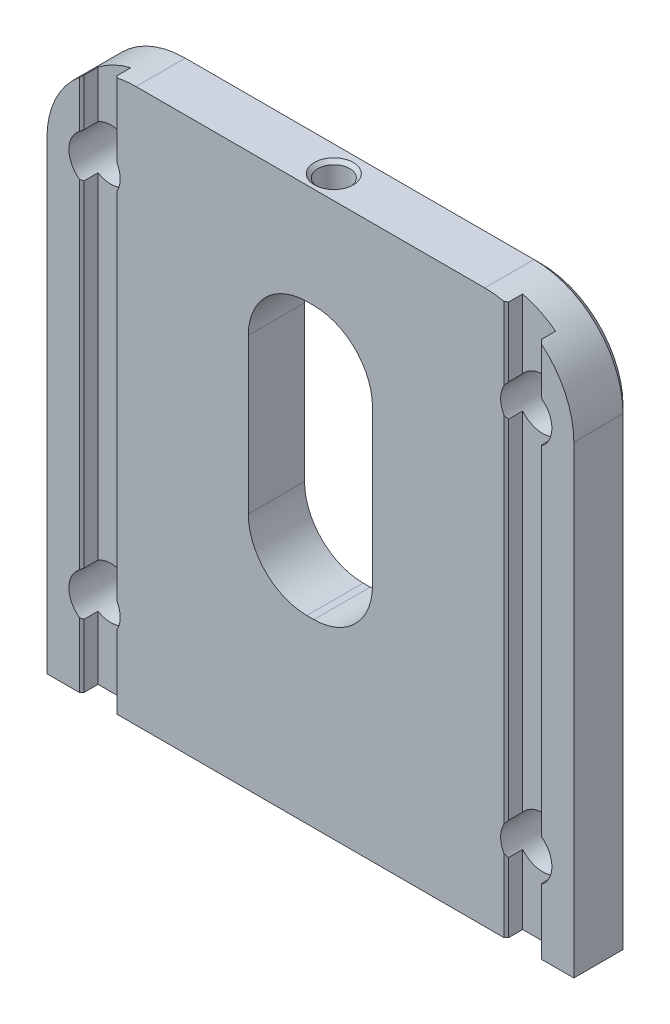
ISO-10303-21;
HEADER;
FILE_DESCRIPTION(('STEP AP214'),'2;1');
FILE_NAME('part.step','',(''),(''),'','','');
FILE_SCHEMA(('AUTOMOTIVE_DESIGN { 1 0 10303 214 1 1 1 1 }'));
ENDSEC;
DATA;
#1=APPLICATION_CONTEXT('core data for automotive mechanical design processes');
#2=APPLICATION_PROTOCOL_DEFINITION('international standard','automotive_design',2000,#1);
#3=PRODUCT_CONTEXT('',#1,'mechanical');
#4=PRODUCT('Part','Part','',(#3));
#5=PRODUCT_RELATED_PRODUCT_CATEGORY('part','',(#4));
#6=PRODUCT_DEFINITION_FORMATION('','',#4);
#7=PRODUCT_DEFINITION_CONTEXT('part definition',#1,'design');
#8=PRODUCT_DEFINITION('design','',#6,#7);
#9=PRODUCT_DEFINITION_SHAPE('','',#8);
#10=(LENGTH_UNIT() NAMED_UNIT(*) SI_UNIT(.MILLI.,.METRE.));
#11=(NAMED_UNIT(*) PLANE_ANGLE_UNIT() SI_UNIT($,.RADIAN.));
#12=(NAMED_UNIT(*) SI_UNIT($,.STERADIAN.) SOLID_ANGLE_UNIT());
#13=UNCERTAINTY_MEASURE_WITH_UNIT(LENGTH_MEASURE(1.E-05),#10,'distance_accuracy_value','');
#14=(GEOMETRIC_REPRESENTATION_CONTEXT(3) GLOBAL_UNCERTAINTY_ASSIGNED_CONTEXT((#13)) GLOBAL_UNIT_ASSIGNED_CONTEXT((#10,
#11,#12)) REPRESENTATION_CONTEXT('',''));
#15=CARTESIAN_POINT('',(0.,0.,0.));
#16=DIRECTION('',(0.,0.,1.));
#17=DIRECTION('',(1.,0.,0.));
#18=AXIS2_PLACEMENT_3D('',#15,#16,#17);
#19=CARTESIAN_POINT('',(-6.731,49.276,-151.47160619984));
#20=DIRECTION('',(0.,-1.,0.));
#21=DIRECTION('',(0.,0.,-1.));
#22=AXIS2_PLACEMENT_3D('',#19,#20,#21);
#23=PLANE('',#22);
#24=DIRECTION('',(0.,0.,1.));
#25=VECTOR('',#24,1.);
#26=CARTESIAN_POINT('',(0.381,49.276,-16.256));
#27=LINE('',#26,#25);
#28=CARTESIAN_POINT('',(0.381,49.276,-17.1113460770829));
#29=VERTEX_POINT('',#28);
#30=CARTESIAN_POINT('',(0.381,49.276,-16.7483440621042));
#31=VERTEX_POINT('',#30);
#32=EDGE_CURVE('E828',#29,#31,#27,.T.);
#33=ORIENTED_EDGE('',*,*,#32,.T.);
#34=CARTESIAN_POINT('',(0.,49.276,-18.796));
#35=DIRECTION('',(0.,-1.,0.));
#36=DIRECTION('',(0.,0.,-1.));
#37=AXIS2_PLACEMENT_3D('',#34,#35,#36);
#38=CIRCLE('',#37,2.0828);
#39=CARTESIAN_POINT('',(-0.381,49.276,-16.7483440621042));
#40=VERTEX_POINT('',#39);
#41=EDGE_CURVE('E794',#31,#40,#38,.T.);
#42=ORIENTED_EDGE('',*,*,#41,.T.);
#43=DIRECTION('',(0.,0.,1.));
#44=VECTOR('',#43,1.);
#45=CARTESIAN_POINT('',(-0.381,49.276,-22.352));
#46=LINE('',#45,#44);
#47=CARTESIAN_POINT('',(-0.381,49.276,-17.1113460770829));
#48=VERTEX_POINT('',#47);
#49=EDGE_CURVE('E825',#40,#48,#46,.F.);
#50=ORIENTED_EDGE('',*,*,#49,.T.);
#51=CARTESIAN_POINT('',(0.,49.276,-18.796));
#52=DIRECTION('',(0.,-1.,0.));
#53=DIRECTION('',(0.,0.,-1.));
#54=AXIS2_PLACEMENT_3D('',#51,#52,#53);
#55=CIRCLE('',#54,1.7272);
#56=EDGE_CURVE('E752',#48,#29,#55,.F.);
#57=ORIENTED_EDGE('',*,*,#56,.T.);
#58=EDGE_LOOP('',(#33,#42,#50,#57));
#59=FACE_BOUND('',#58,.T.);
#60=ADVANCED_FACE('F16',(#59),#23,.T.);
#61=CARTESIAN_POINT('',(-0.381000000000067,49.276,-20.4806539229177));
#62=VERTEX_POINT('',#61);
#63=CARTESIAN_POINT('',(-0.381,49.276,-20.8436559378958));
#64=VERTEX_POINT('',#63);
#65=EDGE_CURVE('E835',#62,#64,#46,.F.);
#66=ORIENTED_EDGE('',*,*,#65,.T.);
#67=CARTESIAN_POINT('',(0.,49.276,-18.796));
#68=DIRECTION('',(0.,-1.,0.));
#69=DIRECTION('',(0.,0.,-1.));
#70=AXIS2_PLACEMENT_3D('',#67,#68,#69);
#71=CIRCLE('',#70,2.0828);
#72=CARTESIAN_POINT('',(0.381,49.276,-20.8436559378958));
#73=VERTEX_POINT('',#72);
#74=EDGE_CURVE('E815',#64,#73,#71,.T.);
#75=ORIENTED_EDGE('',*,*,#74,.T.);
#76=CARTESIAN_POINT('',(0.381,49.276,-20.4806539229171));
#77=VERTEX_POINT('',#76);
#78=EDGE_CURVE('E1129',#73,#77,#27,.T.);
#79=ORIENTED_EDGE('',*,*,#78,.T.);
#80=EDGE_CURVE('E753',#77,#62,#55,.F.);
#81=ORIENTED_EDGE('',*,*,#80,.T.);
#82=EDGE_LOOP('',(#66,#75,#79,#81));
#83=FACE_BOUND('',#82,.T.);
#84=ADVANCED_FACE('F762',(#83),#23,.T.);
#85=CARTESIAN_POINT('',(0.381,42.926,-151.47160619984));
#86=DIRECTION('',(0.,0.,-1.));
#87=DIRECTION('',(-1.,0.,0.));
#88=AXIS2_PLACEMENT_3D('',#85,#86,#87);
#89=CYLINDRICAL_SURFACE('',#88,6.35);
#90=CARTESIAN_POINT('',(0.381,49.276,-16.7483440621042));
#91=CARTESIAN_POINT('',(0.437529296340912,49.2760039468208,-16.7588611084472));
#92=CARTESIAN_POINT('',(0.493592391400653,49.2752443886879,-16.7717171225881));
#93=CARTESIAN_POINT('',(0.604417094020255,49.2723098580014,-16.8019998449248));
#94=CARTESIAN_POINT('',(0.659179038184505,49.270135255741,-16.8194253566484));
#95=CARTESIAN_POINT('',(0.82066505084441,49.2616733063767,-16.878281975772));
#96=CARTESIAN_POINT('',(0.924948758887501,49.2534464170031,-16.9263606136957));
#97=CARTESIAN_POINT('',(1.12383473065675,49.2331959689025,-17.0386972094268));
#98=CARTESIAN_POINT('',(1.21844127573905,49.2211740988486,-17.1029479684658));
#99=CARTESIAN_POINT('',(1.39576017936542,49.1950349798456,-17.24587856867));
#100=CARTESIAN_POINT('',(1.47846856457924,49.1809170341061,-17.3245632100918));
#101=CARTESIAN_POINT('',(1.63195248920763,49.152065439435,-17.4966041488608));
#102=CARTESIAN_POINT('',(1.70235174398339,49.1373254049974,-17.5902952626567));
#103=CARTESIAN_POINT('',(1.82659794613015,49.1095924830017,-17.7883955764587));
#104=CARTESIAN_POINT('',(1.88043621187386,49.0966005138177,-17.8928103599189));
#105=CARTESIAN_POINT('',(1.97016756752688,49.0741058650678,-18.1101413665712));
#106=CARTESIAN_POINT('',(2.00595761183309,49.0646233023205,-18.2231022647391));
#107=CARTESIAN_POINT('',(2.0578318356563,49.0506628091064,-18.4535623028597));
#108=CARTESIAN_POINT('',(2.07396465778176,49.0461725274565,-18.5710494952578));
#109=CARTESIAN_POINT('',(2.08185563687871,49.0439705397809,-18.724004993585));
#110=CARTESIAN_POINT('',(2.08277553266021,49.0437128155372,-18.7591018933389));
#111=CARTESIAN_POINT('',(2.0827992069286,49.0437103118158,-18.7941824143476));
#112=B_SPLINE_CURVE_WITH_KNOTS('',3,(#90,#91,#92,#93,#94,#95,#96,#97,#98,#99,#100,#101,#102,
#103,#104,#105,#106,#107,#108,#109,#110,#111),.UNSPECIFIED.,.F.,.F.,(4,2,2,2,2,2,2,2,2,2,4),(0.,
0.172384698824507,0.344724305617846,0.688320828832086,1.03176467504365,1.37532294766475,
1.72802722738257,2.08091608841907,2.43579756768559,2.78979908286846,2.89507613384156),.UNSPECIFIED.);
#113=CARTESIAN_POINT('',(2.0827992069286,49.0437103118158,-18.7941824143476));
#114=VERTEX_POINT('',#113);
#115=EDGE_CURVE('E793',#31,#114,#112,.T.);
#116=ORIENTED_EDGE('',*,*,#115,.F.);
#117=ORIENTED_EDGE('',*,*,#32,.F.);
#118=CARTESIAN_POINT('',(0.,49.2645596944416,-17.0688));
#119=CARTESIAN_POINT('',(-0.0961837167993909,49.2587764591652,-17.0688026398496));
#120=CARTESIAN_POINT('',(-0.192262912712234,49.2507837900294,-17.0768619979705));
#121=CARTESIAN_POINT('',(-0.381378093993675,49.2307871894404,-17.1087006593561));
#122=CARTESIAN_POINT('',(-0.474412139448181,49.2187807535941,-17.1324897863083));
#123=CARTESIAN_POINT('',(-0.654696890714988,49.1916310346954,-17.1948521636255));
#124=CARTESIAN_POINT('',(-0.741957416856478,49.1764932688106,-17.2333995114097));
#125=CARTESIAN_POINT('',(-0.908685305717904,49.1442338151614,-17.3240893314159));
#126=CARTESIAN_POINT('',(-0.988152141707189,49.1271119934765,-17.376232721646));
#127=CARTESIAN_POINT('',(-1.13948826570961,49.0917786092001,-17.494364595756));
#128=CARTESIAN_POINT('',(-1.21108439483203,49.0735499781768,-17.5606981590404));
#129=CARTESIAN_POINT('',(-1.34222883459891,49.0380869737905,-17.7046151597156));
#130=CARTESIAN_POINT('',(-1.40177548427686,49.0208527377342,-17.7822001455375));
#131=CARTESIAN_POINT('',(-1.50774493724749,48.9888583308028,-17.9476582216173));
#132=CARTESIAN_POINT('',(-1.55400879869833,48.9741289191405,-18.0356394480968));
#133=CARTESIAN_POINT('',(-1.6309088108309,48.9489870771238,-18.2187585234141));
#134=CARTESIAN_POINT('',(-1.66155048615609,48.9385731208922,-18.3138938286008));
#135=CARTESIAN_POINT('',(-1.70508936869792,48.9236031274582,-18.5043925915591));
#136=CARTESIAN_POINT('',(-1.71867317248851,48.9188209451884,-18.5995811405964));
#137=CARTESIAN_POINT('',(-1.72984948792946,48.9148942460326,-18.7909968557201));
#138=CARTESIAN_POINT('',(-1.72744630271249,48.915748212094,-18.8872237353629));
#139=CARTESIAN_POINT('',(-1.70718701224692,48.9228388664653,-19.0738132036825));
#140=CARTESIAN_POINT('',(-1.68996776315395,48.9288536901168,-19.1642545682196));
#141=CARTESIAN_POINT('',(-1.64155713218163,48.9453363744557,-19.3408835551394));
#142=CARTESIAN_POINT('',(-1.61036425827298,48.9558047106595,-19.4270707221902));
#143=CARTESIAN_POINT('',(-1.53433381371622,48.9803878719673,-19.594529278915));
#144=CARTESIAN_POINT('',(-1.48926082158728,48.994564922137,-19.6756843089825));
#145=CARTESIAN_POINT('',(-1.38696984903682,49.0251496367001,-19.8294744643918));
#146=CARTESIAN_POINT('',(-1.32974859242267,49.0415579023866,-19.9021072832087));
#147=CARTESIAN_POINT('',(-1.20137305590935,49.0760590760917,-20.0407063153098));
#148=CARTESIAN_POINT('',(-1.12965535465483,49.0941952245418,-20.1061407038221));
#149=CARTESIAN_POINT('',(-0.976171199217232,49.1297719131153,-20.2241751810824));
#150=CARTESIAN_POINT('',(-0.89440329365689,49.1472123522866,-20.276773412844));
#151=CARTESIAN_POINT('',(-0.72128736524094,49.1802270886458,-20.368491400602));
#152=CARTESIAN_POINT('',(-0.629792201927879,49.1957616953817,-20.4073487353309));
#153=CARTESIAN_POINT('',(-0.441012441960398,49.223291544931,-20.4688949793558));
#154=CARTESIAN_POINT('',(-0.343729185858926,49.2352876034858,-20.4915876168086));
#155=CARTESIAN_POINT('',(-0.149334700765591,49.2545454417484,-20.5194439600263));
#156=CARTESIAN_POINT('',(-0.0523118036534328,49.2619425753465,-20.5251297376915));
#157=CARTESIAN_POINT('',(0.141543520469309,49.2722253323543,-20.520117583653));
#158=CARTESIAN_POINT('',(0.238375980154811,49.2751118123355,-20.5094227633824));
#159=CARTESIAN_POINT('',(0.425952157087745,49.2765129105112,-20.4724970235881));
#160=CARTESIAN_POINT('',(0.516791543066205,49.2751592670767,-20.446754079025));
#161=CARTESIAN_POINT('',(0.692964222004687,49.2689451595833,-20.3808865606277));
#162=CARTESIAN_POINT('',(0.778297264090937,49.2640845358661,-20.3407613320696));
#163=CARTESIAN_POINT('',(0.941784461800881,49.2517253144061,-20.2469353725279));
#164=CARTESIAN_POINT('',(1.01987933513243,49.2442070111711,-20.1931341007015));
#165=CARTESIAN_POINT('',(1.16614976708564,49.2277034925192,-20.073591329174));
#166=CARTESIAN_POINT('',(1.23432370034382,49.218718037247,-20.0078478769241));
#167=CARTESIAN_POINT('',(1.36067042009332,49.2003076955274,-19.8642597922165));
#168=CARTESIAN_POINT('',(1.41853210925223,49.190877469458,-19.7861417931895));
#169=CARTESIAN_POINT('',(1.5204031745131,49.1731548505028,-19.6212200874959));
#170=CARTESIAN_POINT('',(1.56441231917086,49.1648624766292,-19.5344162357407));
#171=CARTESIAN_POINT('',(1.63743543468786,49.1505697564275,-19.3541370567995));
#172=CARTESIAN_POINT('',(1.66639164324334,49.1445782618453,-19.2606375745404));
#173=CARTESIAN_POINT('',(1.70812496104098,49.1358068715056,-19.0699536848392));
#174=CARTESIAN_POINT('',(1.72090465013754,49.1330264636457,-18.972769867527));
#175=CARTESIAN_POINT('',(1.72977132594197,49.1311055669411,-18.7796002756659));
#176=CARTESIAN_POINT('',(1.72619342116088,49.1318920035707,-18.6836304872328));
#177=CARTESIAN_POINT('',(1.70322696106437,49.1368252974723,-18.4936946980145));
#178=CARTESIAN_POINT('',(1.68383860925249,49.1409721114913,-18.3997286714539));
#179=CARTESIAN_POINT('',(1.63001338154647,49.1520106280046,-18.2169433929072));
#180=CARTESIAN_POINT('',(1.59565779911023,49.1588874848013,-18.1280992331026));
#181=CARTESIAN_POINT('',(1.51291924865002,49.174441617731,-17.9573722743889));
#182=CARTESIAN_POINT('',(1.46453457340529,49.1831191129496,-17.8754903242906));
#183=CARTESIAN_POINT('',(1.35396787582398,49.2012708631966,-17.7192799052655));
#184=CARTESIAN_POINT('',(1.29153348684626,49.2107574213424,-17.6451314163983));
#185=CARTESIAN_POINT('',(1.15509506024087,49.2290154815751,-17.5082443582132));
#186=CARTESIAN_POINT('',(1.08108917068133,49.2377868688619,-17.4455076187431));
#187=CARTESIAN_POINT('',(0.922810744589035,49.2533462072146,-17.3327288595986));
#188=CARTESIAN_POINT('',(0.838456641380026,49.2601167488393,-17.2827987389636));
#189=CARTESIAN_POINT('',(0.66239085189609,49.2703730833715,-17.1978773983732));
#190=CARTESIAN_POINT('',(0.570684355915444,49.2738611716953,-17.1628757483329));
#191=CARTESIAN_POINT('',(0.399270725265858,49.2764467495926,-17.1136512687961));
#192=CARTESIAN_POINT('',(0.320303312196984,49.27621063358,-17.0968510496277));
#193=CARTESIAN_POINT('',(0.160866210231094,49.272684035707,-17.0744245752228));
#194=CARTESIAN_POINT('',(0.0803965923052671,49.2693936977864,-17.0687977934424));
#195=CARTESIAN_POINT('',(0.,49.2645596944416,-17.0688));
#196=B_SPLINE_CURVE_WITH_KNOTS('',3,(#118,#119,#120,#121,#122,#123,#124,#125,#126,#127,#128,
#129,#130,#131,#132,#133,#134,#135,#136,#137,#138,#139,#140,#141,#142,#143,#144,#145,#146,#147,
#148,#149,#150,#151,#152,#153,#154,#155,#156,#157,#158,#159,#160,#161,#162,#163,#164,#165,#166,
#167,#168,#169,#170,#171,#172,#173,#174,#175,#176,#177,#178,#179,#180,#181,#182,#183,#184,#185,
#186,#187,#188,#189,#190,#191,#192,#193,#194,#195),.UNSPECIFIED.,.T.,.F.,(4,2,2,2,2,2,2,2,2,2,2,
2,2,2,2,2,2,2,2,2,2,2,2,2,2,2,2,2,2,2,2,2,2,2,2,2,2,2,4),(0.,0.288771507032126,
0.577723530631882,0.866170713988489,1.15463737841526,1.45113618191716,1.74767582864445,
2.0476285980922,2.34747521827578,2.63481952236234,2.92208648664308,3.19758933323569,
3.47312160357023,3.75361176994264,4.03417767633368,4.32911038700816,4.62408573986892,
4.92442371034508,5.22469238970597,5.51564375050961,5.80653985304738,6.08848861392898,
6.37045021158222,6.65454786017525,6.9386920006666,7.2303281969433,7.52196926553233,
7.81472133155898,8.10742670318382,8.39416277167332,8.68089514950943,8.96608920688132,
9.25131798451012,9.54214985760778,9.83302832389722,10.1263678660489,10.4195021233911,
10.6608874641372,10.9022614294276),.UNSPECIFIED.);
#197=EDGE_CURVE('E705',#77,#29,#196,.T.);
#198=ORIENTED_EDGE('',*,*,#197,.F.);
#199=ORIENTED_EDGE('',*,*,#78,.F.);
#200=CARTESIAN_POINT('',(2.0828,49.0437100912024,-18.796));
#201=CARTESIAN_POINT('',(2.08280089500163,49.0437049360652,-18.853549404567));
#202=CARTESIAN_POINT('',(2.08041328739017,49.0443745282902,-18.9110700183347));
#203=CARTESIAN_POINT('',(2.07089655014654,49.047011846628,-19.0256762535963));
#204=CARTESIAN_POINT('',(2.06376837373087,49.0489793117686,-19.0827619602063));
#205=CARTESIAN_POINT('',(2.03538265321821,49.0567361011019,-19.2524893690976));
#206=CARTESIAN_POINT('',(2.00712340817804,49.0643804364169,-19.363957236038));
#207=CARTESIAN_POINT('',(1.93286325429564,49.0835701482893,-19.5803476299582));
#208=CARTESIAN_POINT('',(1.88686591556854,49.0951147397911,-19.6852714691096));
#209=CARTESIAN_POINT('',(1.77847473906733,49.1205664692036,-19.8859963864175));
#210=CARTESIAN_POINT('',(1.7160764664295,49.1344742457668,-19.981794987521));
#211=CARTESIAN_POINT('',(1.57490770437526,49.1631772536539,-20.163957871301));
#212=CARTESIAN_POINT('',(1.4957912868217,49.1779855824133,-20.2500520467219));
#213=CARTESIAN_POINT('',(1.32408689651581,49.2061785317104,-20.4079731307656));
#214=CARTESIAN_POINT('',(1.23149081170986,49.2195622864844,-20.4797913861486));
#215=CARTESIAN_POINT('',(1.03435029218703,49.2430865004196,-20.6076612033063));
#216=CARTESIAN_POINT('',(0.929701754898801,49.2531953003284,-20.6635582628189));
#217=CARTESIAN_POINT('',(0.712296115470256,49.2682799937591,-20.7567659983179));
#218=CARTESIAN_POINT('',(0.599560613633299,49.2732690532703,-20.7941242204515));
#219=CARTESIAN_POINT('',(0.450233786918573,49.2757185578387,-20.8298659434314));
#220=CARTESIAN_POINT('',(0.415691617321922,49.2760051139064,-20.8372082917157));
#221=CARTESIAN_POINT('',(0.381,49.276,-20.8436559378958));
#222=B_SPLINE_CURVE_WITH_KNOTS('',3,(#200,#201,#202,#203,#204,#205,#206,#207,#208,#209,#210,
#211,#212,#213,#214,#215,#216,#217,#218,#219,#220,#221),.UNSPECIFIED.,.F.,.F.,(4,2,2,2,2,2,2,2,
2,2,4),(0.,0.172538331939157,0.345041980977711,0.688995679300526,1.03288018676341,
1.37685777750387,1.72880742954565,2.08096976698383,2.43644139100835,2.79099657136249,
2.89688792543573),.UNSPECIFIED.);
#223=CARTESIAN_POINT('',(2.0828,49.0437100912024,-18.796));
#224=VERTEX_POINT('',#223);
#225=EDGE_CURVE('E786',#224,#73,#222,.T.);
#226=ORIENTED_EDGE('',*,*,#225,.F.);
#227=CARTESIAN_POINT('',(0.381,42.926,-18.796));
#228=DIRECTION('',(0.,0.,1.));
#229=DIRECTION('',(1.,0.,0.));
#230=AXIS2_PLACEMENT_3D('',#227,#228,#229);
#231=CIRCLE('',#230,6.35);
#232=CARTESIAN_POINT('',(2.083054,49.0436394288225,-18.796));
#233=VERTEX_POINT('',#232);
#234=EDGE_CURVE('E1173',#233,#224,#231,.T.);
#235=ORIENTED_EDGE('',*,*,#234,.F.);
#236=CARTESIAN_POINT('',(2.083054,49.0436394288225,-18.796));
#237=CARTESIAN_POINT('',(2.08305489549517,49.0436342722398,-18.8535560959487));
#238=CARTESIAN_POINT('',(2.08066702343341,49.0443040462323,-18.9110833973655));
#239=CARTESIAN_POINT('',(2.07114923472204,49.0469420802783,-19.0257029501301));
#240=CARTESIAN_POINT('',(2.06402027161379,49.0489100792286,-19.0827952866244));
#241=CARTESIAN_POINT('',(2.03563143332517,49.0566689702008,-19.2525423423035));
#242=CARTESIAN_POINT('',(2.00736909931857,49.0643153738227,-19.3640230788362));
#243=CARTESIAN_POINT('',(1.93310089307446,49.0835102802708,-19.5804384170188));
#244=CARTESIAN_POINT('',(1.88709859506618,49.0950579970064,-19.685374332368));
#245=CARTESIAN_POINT('',(1.77869578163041,49.1205166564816,-19.8861224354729));
#246=CARTESIAN_POINT('',(1.71629082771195,49.1344282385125,-19.98193214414));
#247=CARTESIAN_POINT('',(1.57510646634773,49.1631393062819,-20.1641169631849));
#248=CARTESIAN_POINT('',(1.49598098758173,49.1779518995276,-20.2502218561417));
#249=CARTESIAN_POINT('',(1.32425679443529,49.2061531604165,-20.4081627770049));
#250=CARTESIAN_POINT('',(1.23164996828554,49.2195409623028,-20.4799901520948));
#251=CARTESIAN_POINT('',(1.03448596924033,49.2430726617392,-20.6078767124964));
#252=CARTESIAN_POINT('',(0.929824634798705,49.2531848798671,-20.6637813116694));
#253=CARTESIAN_POINT('',(0.712392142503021,49.2682752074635,-20.7570018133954));
#254=CARTESIAN_POINT('',(0.599642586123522,49.2732664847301,-20.7943652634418));
#255=CARTESIAN_POINT('',(0.450279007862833,49.2757181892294,-20.8301164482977));
#256=CARTESIAN_POINT('',(0.415714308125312,49.2760051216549,-20.8374632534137));
#257=CARTESIAN_POINT('',(0.381,49.276,-20.8439142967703));
#258=B_SPLINE_CURVE_WITH_KNOTS('',3,(#236,#237,#238,#239,#240,#241,#242,#243,#244,#245,#246,
#247,#248,#249,#250,#251,#252,#253,#254,#255,#256,#257),.UNSPECIFIED.,.F.,.F.,(4,2,2,2,2,2,2,2,
2,2,4),(0.,0.172558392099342,0.345082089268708,0.689075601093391,1.03299984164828,
1.37701724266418,1.72901005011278,2.08121553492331,2.43673213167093,2.79133225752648,
2.897292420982),.UNSPECIFIED.);
#259=CARTESIAN_POINT('',(0.381,49.276,-20.8439142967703));
#260=VERTEX_POINT('',#259);
#261=EDGE_CURVE('E771',#233,#260,#258,.T.);
#262=ORIENTED_EDGE('',*,*,#261,.T.);
#263=CARTESIAN_POINT('',(0.381,49.276,-22.352));
#264=VERTEX_POINT('',#263);
#265=EDGE_CURVE('E1130',#264,#260,#27,.T.);
#266=ORIENTED_EDGE('',*,*,#265,.F.);
#267=CARTESIAN_POINT('',(0.381,42.926,-22.352));
#268=DIRECTION('',(0.,0.,-1.));
#269=DIRECTION('',(-1.,0.,0.));
#270=AXIS2_PLACEMENT_3D('',#267,#268,#269);
#271=CIRCLE('',#270,6.35);
#272=CARTESIAN_POINT('',(6.731,42.926,-22.352));
#273=VERTEX_POINT('',#272);
#274=EDGE_CURVE('E1144',#273,#264,#271,.F.);
#275=ORIENTED_EDGE('',*,*,#274,.F.);
#276=DIRECTION('',(0.,0.,1.));
#277=VECTOR('',#276,1.);
#278=CARTESIAN_POINT('',(6.731,42.926,-22.352));
#279=LINE('',#278,#277);
#280=CARTESIAN_POINT('',(6.731,42.926,-16.256));
#281=VERTEX_POINT('',#280);
#282=EDGE_CURVE('E849',#281,#273,#279,.F.);
#283=ORIENTED_EDGE('',*,*,#282,.F.);
#284=CARTESIAN_POINT('',(0.381,42.926,-16.256));
#285=DIRECTION('',(0.,0.,1.));
#286=DIRECTION('',(1.,0.,0.));
#287=AXIS2_PLACEMENT_3D('',#284,#285,#286);
#288=CIRCLE('',#287,6.35);
#289=CARTESIAN_POINT('',(0.381,49.276,-16.256));
#290=VERTEX_POINT('',#289);
#291=EDGE_CURVE('E1128',#290,#281,#288,.F.);
#292=ORIENTED_EDGE('',*,*,#291,.F.);
#293=CARTESIAN_POINT('',(0.381,49.276,-16.7480857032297));
#294=VERTEX_POINT('',#293);
#295=EDGE_CURVE('E839',#294,#290,#27,.T.);
#296=ORIENTED_EDGE('',*,*,#295,.F.);
#297=CARTESIAN_POINT('',(0.381,49.276,-16.7480857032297));
#298=CARTESIAN_POINT('',(0.437536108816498,49.2760039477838,-16.758602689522));
#299=CARTESIAN_POINT('',(0.49360601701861,49.2752442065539,-16.7714589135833));
#300=CARTESIAN_POINT('',(0.604444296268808,49.2723089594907,-16.8017425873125));
#301=CARTESIAN_POINT('',(0.659213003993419,49.2701338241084,-16.8191688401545));
#302=CARTESIAN_POINT('',(0.820719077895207,49.2616697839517,-16.8780284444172));
#303=CARTESIAN_POINT('',(0.925015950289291,49.2534408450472,-16.9261100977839));
#304=CARTESIAN_POINT('',(1.12392749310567,49.2331852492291,-17.038454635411));
#305=CARTESIAN_POINT('',(1.21854644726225,49.2211602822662,-17.102710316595));
#306=CARTESIAN_POINT('',(1.39588923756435,49.1950142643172,-17.2456525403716));
#307=CARTESIAN_POINT('',(1.47860909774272,49.1808925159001,-17.3243438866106));
#308=CARTESIAN_POINT('',(1.63211565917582,49.1520328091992,-17.4964006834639));
#309=CARTESIAN_POINT('',(1.70252594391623,49.1372884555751,-17.5901010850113));
#310=CARTESIAN_POINT('',(1.8267925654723,49.10954709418,-17.7882217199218));
#311=CARTESIAN_POINT('',(1.88064022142,49.0965510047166,-17.8926475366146));
#312=CARTESIAN_POINT('',(1.97038869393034,49.0740487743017,-18.1100026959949));
#313=CARTESIAN_POINT('',(2.00618637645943,49.0645627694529,-18.2229767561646));
#314=CARTESIAN_POINT('',(2.05807347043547,49.0505966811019,-18.4534643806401));
#315=CARTESIAN_POINT('',(2.07421152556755,49.0461042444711,-18.5709659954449));
#316=CARTESIAN_POINT('',(2.08210855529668,49.0439002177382,-18.7239590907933));
#317=CARTESIAN_POINT('',(2.08302952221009,49.0436421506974,-18.7590788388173));
#318=CARTESIAN_POINT('',(2.08305320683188,49.0436396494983,-18.7941821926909));
#319=B_SPLINE_CURVE_WITH_KNOTS('',3,(#297,#298,#299,#300,#301,#302,#303,#304,#305,#306,#307,
#308,#309,#310,#311,#312,#313,#314,#315,#316,#317,#318),.UNSPECIFIED.,.F.,.F.,(4,2,2,2,2,2,2,2,
2,2,4),(0.,0.172404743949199,0.344764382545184,0.688400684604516,1.03188421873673,
1.3754822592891,1.72822979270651,2.08116189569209,2.43608835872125,2.79013483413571,
2.89548040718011),.UNSPECIFIED.);
#320=CARTESIAN_POINT('',(2.08305320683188,49.0436396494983,-18.7941821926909));
#321=VERTEX_POINT('',#320);
#322=EDGE_CURVE('E779',#294,#321,#319,.T.);
#323=ORIENTED_EDGE('',*,*,#322,.T.);
#324=CARTESIAN_POINT('',(0.381,42.926,-18.7956675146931));
#325=DIRECTION('',(-0.000872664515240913,0.,0.99999961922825));
#326=DIRECTION('',(-0.99999961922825,0.,-0.000872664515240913));
#327=AXIS2_PLACEMENT_3D('',#324,#325,#326);
#328=ELLIPSE('',#327,6.35000241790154,6.35);
#329=EDGE_CURVE('E425',#114,#321,#328,.F.);
#330=ORIENTED_EDGE('',*,*,#329,.F.);
#331=EDGE_LOOP('',(#116,#117,#198,#199,#226,#235,#262,#266,#275,#283,#292,#296,#323,#330));
#332=FACE_BOUND('',#331,.T.);
#333=ADVANCED_FACE('F757',(#332),#89,.F.);
#334=CARTESIAN_POINT('',(-0.381,42.926,-151.47160619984));
#335=DIRECTION('',(0.,0.,-1.));
#336=DIRECTION('',(-1.,0.,0.));
#337=AXIS2_PLACEMENT_3D('',#334,#335,#336);
#338=CYLINDRICAL_SURFACE('',#337,6.35);
#339=CARTESIAN_POINT('',(-0.381,49.276,-20.8436559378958));
#340=CARTESIAN_POINT('',(-0.43753081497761,49.2760039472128,-20.8331386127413));
#341=CARTESIAN_POINT('',(-0.493595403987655,49.275244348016,-20.8202821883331));
#342=CARTESIAN_POINT('',(-0.604423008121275,49.2723096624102,-20.789998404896));
#343=CARTESIAN_POINT('',(-0.659186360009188,49.2701349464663,-20.7725722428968));
#344=CARTESIAN_POINT('',(-0.820670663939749,49.2616728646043,-20.7137154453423));
#345=CARTESIAN_POINT('',(-0.924951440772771,49.2534461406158,-20.6656379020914));
#346=CARTESIAN_POINT('',(-1.12382909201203,49.2331965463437,-20.5533059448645));
#347=CARTESIAN_POINT('',(-1.21843053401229,49.2211754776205,-20.4890592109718));
#348=CARTESIAN_POINT('',(-1.39575079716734,49.1950365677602,-20.3461304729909));
#349=CARTESIAN_POINT('',(-1.47846429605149,49.1809177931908,-20.2674420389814));
#350=CARTESIAN_POINT('',(-1.63197155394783,49.1520619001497,-20.0953740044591));
#351=CARTESIAN_POINT('',(-1.70238620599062,49.1373183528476,-20.0016570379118));
#352=CARTESIAN_POINT('',(-1.82662465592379,49.1095858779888,-19.8035545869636));
#353=CARTESIAN_POINT('',(-1.88044791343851,49.0965970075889,-19.6991687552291));
#354=CARTESIAN_POINT('',(-1.97011774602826,49.0741189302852,-19.4819718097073));
#355=CARTESIAN_POINT('',(-2.00587687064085,49.0646468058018,-19.3691226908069));
#356=CARTESIAN_POINT('',(-2.05779871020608,49.0506699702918,-19.1387179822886));
#357=CARTESIAN_POINT('',(-2.07396725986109,49.0461637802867,-19.0211638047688));
#358=CARTESIAN_POINT('',(-2.0859269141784,49.0428422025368,-18.7888239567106));
#359=CARTESIAN_POINT('',(-2.0823693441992,49.043844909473,-18.6740740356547));
#360=CARTESIAN_POINT('',(-2.05651142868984,49.0509765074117,-18.4468746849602));
#361=CARTESIAN_POINT('',(-2.03421116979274,49.0571053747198,-18.3344252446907));
#362=CARTESIAN_POINT('',(-1.97192673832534,49.0735578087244,-18.1160479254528));
#363=CARTESIAN_POINT('',(-1.93211301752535,49.0838408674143,-18.0100681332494));
#364=CARTESIAN_POINT('',(-1.8360381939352,49.1072456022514,-17.8061898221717));
#365=CARTESIAN_POINT('',(-1.77977475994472,49.1203676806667,-17.7082924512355));
#366=CARTESIAN_POINT('',(-1.65031625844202,49.1482056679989,-17.5200850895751));
#367=CARTESIAN_POINT('',(-1.57665073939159,49.1629583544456,-17.430104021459));
#368=CARTESIAN_POINT('',(-1.41528676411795,49.1917365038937,-17.2635286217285));
#369=CARTESIAN_POINT('',(-1.32758206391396,49.2057616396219,-17.1869402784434));
#370=CARTESIAN_POINT('',(-1.13879889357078,49.2313521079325,-17.0480979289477));
#371=CARTESIAN_POINT('',(-1.03751781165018,49.2428713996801,-16.9861107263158));
#372=CARTESIAN_POINT('',(-0.82564707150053,49.2612998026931,-16.8801893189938));
#373=CARTESIAN_POINT('',(-0.715075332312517,49.2682175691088,-16.8362212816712));
#374=CARTESIAN_POINT('',(-0.565365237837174,49.2734281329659,-16.7910403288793));
#375=CARTESIAN_POINT('',(-0.528799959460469,49.2743869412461,-16.7810889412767));
#376=CARTESIAN_POINT('',(-0.455224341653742,49.2756721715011,-16.7632055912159));
#377=CARTESIAN_POINT('',(-0.418214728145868,49.2759995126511,-16.7552707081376));
#378=CARTESIAN_POINT('',(-0.381,49.276,-16.7483440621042));
#379=B_SPLINE_CURVE_WITH_KNOTS('',3,(#339,#340,#341,#342,#343,#344,#345,#346,#347,#348,#349,
#350,#351,#352,#353,#354,#355,#356,#357,#358,#359,#360,#361,#362,#363,#364,#365,#366,#367,#368,
#369,#370,#371,#372,#373,#374,#375,#376,#377,#378),.UNSPECIFIED.,.F.,.F.,(4,2,2,2,2,2,2,2,2,2,2,
2,2,2,2,2,2,2,2,4),(0.,0.172389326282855,0.344733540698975,0.688320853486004,1.03174527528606,
1.37532297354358,1.72811380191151,2.08091611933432,2.4354104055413,2.78979908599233,
3.1325575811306,3.47531449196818,3.81480684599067,4.15434733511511,4.50440448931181,
4.85461776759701,5.21080504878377,5.56632045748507,5.67999802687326,5.79350999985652),.UNSPECIFIED.);
#380=EDGE_CURVE('E810',#64,#40,#379,.T.);
#381=ORIENTED_EDGE('',*,*,#380,.F.);
#382=ORIENTED_EDGE('',*,*,#65,.F.);
#383=CARTESIAN_POINT('',(0.,49.2645596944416,-17.0688));
#384=CARTESIAN_POINT('',(-0.0943401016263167,49.2702294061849,-17.0688015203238));
#385=CARTESIAN_POINT('',(-0.188824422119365,49.2737757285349,-17.0765540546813));
#386=CARTESIAN_POINT('',(-0.375331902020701,49.2766831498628,-17.1074249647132));
#387=CARTESIAN_POINT('',(-0.46735435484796,49.2760430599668,-17.1305477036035));
#388=CARTESIAN_POINT('',(-0.646208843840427,49.2710899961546,-17.1914589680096));
#389=CARTESIAN_POINT('',(-0.733045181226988,49.2667801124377,-17.2292351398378));
#390=CARTESIAN_POINT('',(-0.899249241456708,49.2553654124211,-17.3183446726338));
#391=CARTESIAN_POINT('',(-0.978616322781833,49.2482603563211,-17.3696791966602));
#392=CARTESIAN_POINT('',(-1.12893061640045,49.2322591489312,-17.4853284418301));
#393=CARTESIAN_POINT('',(-1.1997365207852,49.2233381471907,-17.5498232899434));
#394=CARTESIAN_POINT('',(-1.32972221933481,49.2050718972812,-17.6895786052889));
#395=CARTESIAN_POINT('',(-1.3889005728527,49.195726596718,-17.7648404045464));
#396=CARTESIAN_POINT('',(-1.49518250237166,49.1777255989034,-17.9258579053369));
#397=CARTESIAN_POINT('',(-1.54200550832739,49.1690885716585,-18.0118012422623));
#398=CARTESIAN_POINT('',(-1.62053467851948,49.153974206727,-18.1905157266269));
#399=CARTESIAN_POINT('',(-1.65224212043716,49.1474966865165,-18.2832862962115));
#400=CARTESIAN_POINT('',(-1.69932164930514,49.1376911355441,-18.4721131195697));
#401=CARTESIAN_POINT('',(-1.71484581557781,49.1343338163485,-18.5681298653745));
#402=CARTESIAN_POINT('',(-1.72957284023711,49.1311520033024,-18.7614592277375));
#403=CARTESIAN_POINT('',(-1.72877777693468,49.1313270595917,-18.8587716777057));
#404=CARTESIAN_POINT('',(-1.71106974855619,49.135145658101,-19.0499800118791));
#405=CARTESIAN_POINT('',(-1.69446192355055,49.1387235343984,-19.1439057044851));
#406=CARTESIAN_POINT('',(-1.64609690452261,49.1487513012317,-19.327608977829));
#407=CARTESIAN_POINT('',(-1.61433871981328,49.1552013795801,-19.4173862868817));
#408=CARTESIAN_POINT('',(-1.5363303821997,49.170140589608,-19.5910049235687));
#409=CARTESIAN_POINT('',(-1.48997670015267,49.1786441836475,-19.6747984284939));
#410=CARTESIAN_POINT('',(-1.38413591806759,49.1964936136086,-19.8335407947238));
#411=CARTESIAN_POINT('',(-1.32464698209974,49.2058395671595,-19.9084884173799));
#412=CARTESIAN_POINT('',(-1.19277214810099,49.2242566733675,-20.0489891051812));
#413=CARTESIAN_POINT('',(-1.12015055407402,49.2333184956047,-20.1143224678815));
#414=CARTESIAN_POINT('',(-0.964808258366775,49.2495872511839,-20.2319153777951));
#415=CARTESIAN_POINT('',(-0.88208796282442,49.2567942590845,-20.2841754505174));
#416=CARTESIAN_POINT('',(-0.709298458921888,49.2680948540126,-20.3738266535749));
#417=CARTESIAN_POINT('',(-0.619270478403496,49.2722047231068,-20.4112950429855));
#418=CARTESIAN_POINT('',(-0.434116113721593,49.2764520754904,-20.4705766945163));
#419=CARTESIAN_POINT('',(-0.338990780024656,49.2765903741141,-20.492393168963));
#420=CARTESIAN_POINT('',(-0.149080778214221,49.2724553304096,-20.5193541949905));
#421=CARTESIAN_POINT('',(-0.0543538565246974,49.268298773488,-20.5249251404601));
#422=CARTESIAN_POINT('',(0.134450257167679,49.2557521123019,-20.5205461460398));
#423=CARTESIAN_POINT('',(0.22852746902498,49.2473621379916,-20.5105966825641));
#424=CARTESIAN_POINT('',(0.412962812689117,49.2268490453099,-20.47571764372));
#425=CARTESIAN_POINT('',(0.503336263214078,49.2147435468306,-20.4508582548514));
#426=CARTESIAN_POINT('',(0.678508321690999,49.1876137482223,-20.3870811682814));
#427=CARTESIAN_POINT('',(0.763305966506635,49.1725889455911,-20.348161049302));
#428=CARTESIAN_POINT('',(0.927897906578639,49.1402215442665,-20.2559341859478));
#429=CARTESIAN_POINT('',(1.00744426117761,49.1228200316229,-20.2022057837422));
#430=CARTESIAN_POINT('',(1.15651812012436,49.0875271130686,-20.0824037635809));
#431=CARTESIAN_POINT('',(1.22604309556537,49.0696355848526,-20.016327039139));
#432=CARTESIAN_POINT('',(1.35529775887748,49.0343877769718,-19.8712267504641));
#433=CARTESIAN_POINT('',(1.41466146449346,49.0170647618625,-19.7918681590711));
#434=CARTESIAN_POINT('',(1.51915807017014,48.9852816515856,-19.6237497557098));
#435=CARTESIAN_POINT('',(1.56429280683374,48.9708211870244,-19.5349911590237));
#436=CARTESIAN_POINT('',(1.63808580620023,48.946571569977,-19.3522517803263));
#437=CARTESIAN_POINT('',(1.66704170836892,48.9366986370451,-19.2584027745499));
#438=CARTESIAN_POINT('',(1.708656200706,48.9223599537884,-19.0667704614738));
#439=CARTESIAN_POINT('',(1.72132153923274,48.917891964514,-18.9689888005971));
#440=CARTESIAN_POINT('',(1.72961805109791,48.9149736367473,-18.7776732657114));
#441=CARTESIAN_POINT('',(1.72609166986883,48.9162256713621,-18.684179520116));
#442=CARTESIAN_POINT('',(1.70405570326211,48.9239310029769,-18.4992028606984));
#443=CARTESIAN_POINT('',(1.68554667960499,48.9303841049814,-18.407719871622));
#444=CARTESIAN_POINT('',(1.63453467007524,48.9476963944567,-18.2303722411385));
#445=CARTESIAN_POINT('',(1.60219719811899,48.9585033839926,-18.1444545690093));
#446=CARTESIAN_POINT('',(1.52459719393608,48.9834626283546,-17.9792007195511));
#447=CARTESIAN_POINT('',(1.47933204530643,48.9976155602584,-17.8998658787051));
#448=CARTESIAN_POINT('',(1.37487577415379,49.0286624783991,-17.7462685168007));
#449=CARTESIAN_POINT('',(1.31516098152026,49.0456494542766,-17.6723810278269));
#450=CARTESIAN_POINT('',(1.18454678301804,49.0803581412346,-17.5354334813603));
#451=CARTESIAN_POINT('',(1.11364362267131,49.0980800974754,-17.472377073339));
#452=CARTESIAN_POINT('',(0.959292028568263,49.1334654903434,-17.356322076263));
#453=CARTESIAN_POINT('',(0.875452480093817,49.1510976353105,-17.3038327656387));
#454=CARTESIAN_POINT('',(0.699699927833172,49.1839996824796,-17.2137934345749));
#455=CARTESIAN_POINT('',(0.607790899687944,49.1992707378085,-17.1762361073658));
#456=CARTESIAN_POINT('',(0.430524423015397,49.2244837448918,-17.1210804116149));
#457=CARTESIAN_POINT('',(0.345826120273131,49.2348569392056,-17.1015475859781));
#458=CARTESIAN_POINT('',(0.174125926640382,49.2522765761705,-17.0754078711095));
#459=CARTESIAN_POINT('',(0.0871244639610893,49.259323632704,-17.0687985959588));
#460=CARTESIAN_POINT('',(0.,49.2645596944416,-17.0688));
#461=B_SPLINE_CURVE_WITH_KNOTS('',3,(#383,#384,#385,#386,#387,#388,#389,#390,#391,#392,#393,
#394,#395,#396,#397,#398,#399,#400,#401,#402,#403,#404,#405,#406,#407,#408,#409,#410,#411,#412,
#413,#414,#415,#416,#417,#418,#419,#420,#421,#422,#423,#424,#425,#426,#427,#428,#429,#430,#431,
#432,#433,#434,#435,#436,#437,#438,#439,#440,#441,#442,#443,#444,#445,#446,#447,#448,#449,#450,
#451,#452,#453,#454,#455,#456,#457,#458,#459,#460),.UNSPECIFIED.,.T.,.F.,(4,2,2,2,2,2,2,2,2,2,2,
2,2,2,2,2,2,2,2,2,2,2,2,2,2,2,2,2,2,2,2,2,2,2,2,2,2,2,4),(0.,0.283217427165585,
0.566515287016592,0.849574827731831,1.13265865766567,1.41991396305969,1.70720483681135,
2.00054661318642,2.29386358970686,2.58439862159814,2.87489665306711,3.1599001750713,
3.44492233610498,3.73201358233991,4.01914498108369,4.31206142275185,4.60496608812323,
4.89631996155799,5.18761402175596,5.47119050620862,5.75475828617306,6.03700157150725,
6.3192934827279,6.61064579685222,6.90207150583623,7.20243860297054,7.50276691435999,
7.79737107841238,8.09185316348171,8.37119230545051,8.65052097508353,8.92659600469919,
9.20272694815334,9.49096770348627,9.77930539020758,10.0792923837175,10.3791324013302,
10.6407361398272,10.9022915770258),.UNSPECIFIED.);
#462=EDGE_CURVE('E686',#48,#62,#461,.T.);
#463=ORIENTED_EDGE('',*,*,#462,.F.);
#464=ORIENTED_EDGE('',*,*,#49,.F.);
#465=EDGE_LOOP('',(#381,#382,#463,#464));
#466=FACE_BOUND('',#465,.T.);
#467=ADVANCED_FACE('F761',(#466),#338,.F.);
#468=CARTESIAN_POINT('',(0.,60.198,-18.796));
#469=DIRECTION('',(0.,1.,0.));
#470=DIRECTION('',(0.,0.,1.));
#471=AXIS2_PLACEMENT_3D('',#468,#469,#470);
#472=CONICAL_SURFACE('',#471,2.1082,0.785398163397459);
#473=CARTESIAN_POINT('',(0.,60.198,-18.796));
#474=DIRECTION('',(0.,-1.,0.));
#475=DIRECTION('',(1.,0.,0.));
#476=AXIS2_PLACEMENT_3D('',#473,#474,#475);
#477=CIRCLE('',#476,2.1082);
#478=CARTESIAN_POINT('',(2.1082,60.198,-18.796));
#479=VERTEX_POINT('',#478);
#480=EDGE_CURVE('E432',#479,#479,#477,.T.);
#481=ORIENTED_EDGE('',*,*,#480,.F.);
#482=EDGE_LOOP('',(#481));
#483=FACE_BOUND('',#482,.T.);
#484=CARTESIAN_POINT('',(0.,59.817,-18.796));
#485=DIRECTION('',(0.,-1.,0.));
#486=DIRECTION('',(0.,0.,-1.));
#487=AXIS2_PLACEMENT_3D('',#484,#485,#486);
#488=CIRCLE('',#487,1.7272);
#489=CARTESIAN_POINT('',(0.,59.817,-20.5232));
#490=VERTEX_POINT('',#489);
#491=EDGE_CURVE('E418',#490,#490,#488,.F.);
#492=ORIENTED_EDGE('',*,*,#491,.F.);
#493=EDGE_LOOP('',(#492));
#494=FACE_BOUND('',#493,.T.);
#495=DIRECTION('',(0.707106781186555,0.70710678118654,0.));
#496=VECTOR('',#495,1.);
#497=CARTESIAN_POINT('',(0.,58.0898,-18.796));
#498=LINE('',#497,#496);
#499=CARTESIAN_POINT('',(2.083054,60.172854,-18.796));
#500=VERTEX_POINT('',#499);
#501=CARTESIAN_POINT('',(2.0828,60.1726,-18.796));
#502=VERTEX_POINT('',#501);
#503=EDGE_CURVE('E24',#500,#502,#498,.F.);
#504=ORIENTED_EDGE('',*,*,#503,.T.);
#505=CARTESIAN_POINT('',(0.,60.1726,-18.796));
#506=DIRECTION('',(0.,1.,0.));
#507=DIRECTION('',(0.,0.,1.));
#508=AXIS2_PLACEMENT_3D('',#505,#506,#507);
#509=CIRCLE('',#508,2.0828);
#510=CARTESIAN_POINT('',(2.0827992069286,60.1726,-18.7941824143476));
#511=VERTEX_POINT('',#510);
#512=EDGE_CURVE('E10',#502,#511,#509,.T.);
#513=ORIENTED_EDGE('',*,*,#512,.T.);
#514=DIRECTION('',(0.707106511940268,0.70710678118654,0.000617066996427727));
#515=VECTOR('',#514,1.);
#516=CARTESIAN_POINT('',(0.,58.0898,-18.796));
#517=LINE('',#516,#515);
#518=CARTESIAN_POINT('',(2.08305320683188,60.172854,-18.7941821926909));
#519=VERTEX_POINT('',#518);
#520=EDGE_CURVE('E417',#511,#519,#517,.T.);
#521=ORIENTED_EDGE('',*,*,#520,.T.);
#522=CARTESIAN_POINT('',(0.,60.172854,-18.796));
#523=DIRECTION('',(0.,1.,0.));
#524=DIRECTION('',(0.,0.,1.));
#525=AXIS2_PLACEMENT_3D('',#522,#523,#524);
#526=CIRCLE('',#525,2.083054);
#527=EDGE_CURVE('E409',#500,#519,#526,.T.);
#528=ORIENTED_EDGE('',*,*,#527,.F.);
#529=EDGE_LOOP('',(#504,#513,#521,#528));
#530=FACE_BOUND('',#529,.T.);
#531=ADVANCED_FACE('F427',(#483,#494,#530),#472,.F.);
#532=CARTESIAN_POINT('',(-28.5496,60.198,-22.352));
#533=DIRECTION('',(0.,0.,-1.));
#534=DIRECTION('',(-1.,0.,0.));
#535=AXIS2_PLACEMENT_3D('',#532,#533,#534);
#536=PLANE('',#535);
#537=DIRECTION('',(1.,0.,0.));
#538=VECTOR('',#537,1.);
#539=CARTESIAN_POINT('',(18.8976,59.436,-22.352));
#540=LINE('',#539,#538);
#541=CARTESIAN_POINT('',(-18.8976,59.436,-22.352));
#542=VERTEX_POINT('',#541);
#543=CARTESIAN_POINT('',(18.8976,59.436,-22.352));
#544=VERTEX_POINT('',#543);
#545=EDGE_CURVE('E663',#542,#544,#540,.T.);
#546=ORIENTED_EDGE('',*,*,#545,.T.);
#547=CARTESIAN_POINT('',(18.8976,50.546,-22.352));
#548=DIRECTION('',(0.,0.,-1.));
#549=DIRECTION('',(-1.,0.,0.));
#550=AXIS2_PLACEMENT_3D('',#547,#548,#549);
#551=CIRCLE('',#550,8.89);
#552=CARTESIAN_POINT('',(27.7876,50.546,-22.352));
#553=VERTEX_POINT('',#552);
#554=EDGE_CURVE('E660',#544,#553,#551,.T.);
#555=ORIENTED_EDGE('',*,*,#554,.T.);
#556=DIRECTION('',(0.,-1.,0.));
#557=VECTOR('',#556,1.);
#558=CARTESIAN_POINT('',(27.7876,60.198,-22.352));
#559=LINE('',#558,#557);
#560=CARTESIAN_POINT('',(27.7876,1.016,-22.352));
#561=VERTEX_POINT('',#560);
#562=EDGE_CURVE('E593',#553,#561,#559,.T.);
#563=ORIENTED_EDGE('',*,*,#562,.T.);
#564=DIRECTION('',(-1.,0.,0.));
#565=VECTOR('',#564,1.);
#566=CARTESIAN_POINT('',(-28.5496,1.01599999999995,-22.352));
#567=LINE('',#566,#565);
#568=CARTESIAN_POINT('',(-27.7876,1.01599999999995,-22.352));
#569=VERTEX_POINT('',#568);
#570=EDGE_CURVE('E669',#561,#569,#567,.T.);
#571=ORIENTED_EDGE('',*,*,#570,.T.);
#572=DIRECTION('',(0.,1.,0.));
#573=VECTOR('',#572,1.);
#574=CARTESIAN_POINT('',(-27.7876,60.198,-22.352));
#575=LINE('',#574,#573);
#576=CARTESIAN_POINT('',(-27.7876,50.546,-22.352));
#577=VERTEX_POINT('',#576);
#578=EDGE_CURVE('E667',#569,#577,#575,.T.);
#579=ORIENTED_EDGE('',*,*,#578,.T.);
#580=CARTESIAN_POINT('',(-18.8976,50.546,-22.352));
#581=DIRECTION('',(0.,0.,-1.));
#582=DIRECTION('',(-1.,0.,0.));
#583=AXIS2_PLACEMENT_3D('',#580,#581,#582);
#584=CIRCLE('',#583,8.89);
#585=EDGE_CURVE('E665',#577,#542,#584,.T.);
#586=ORIENTED_EDGE('',*,*,#585,.T.);
#587=EDGE_LOOP('',(#546,#555,#563,#571,#579,#586));
#588=FACE_BOUND('',#587,.T.);
#589=DIRECTION('',(0.,1.,0.));
#590=VECTOR('',#589,1.);
#591=CARTESIAN_POINT('',(6.731,60.198,-22.352));
#592=LINE('',#591,#590);
#593=CARTESIAN_POINT('',(6.731,26.162,-22.352));
#594=VERTEX_POINT('',#593);
#595=EDGE_CURVE('E883',#594,#273,#592,.T.);
#596=ORIENTED_EDGE('',*,*,#595,.T.);
#597=ORIENTED_EDGE('',*,*,#274,.T.);
#598=DIRECTION('',(-1.,0.,0.));
#599=VECTOR('',#598,1.);
#600=CARTESIAN_POINT('',(-28.5496,49.276,-22.352));
#601=LINE('',#600,#599);
#602=CARTESIAN_POINT('',(-0.381,49.276,-22.352));
#603=VERTEX_POINT('',#602);
#604=EDGE_CURVE('E881',#264,#603,#601,.T.);
#605=ORIENTED_EDGE('',*,*,#604,.T.);
#606=CARTESIAN_POINT('',(-0.381,42.926,-22.352));
#607=DIRECTION('',(0.,0.,-1.));
#608=DIRECTION('',(-1.,0.,0.));
#609=AXIS2_PLACEMENT_3D('',#606,#607,#608);
#610=CIRCLE('',#609,6.35);
#611=CARTESIAN_POINT('',(-6.731,42.926,-22.352));
#612=VERTEX_POINT('',#611);
#613=EDGE_CURVE('E732',#603,#612,#610,.F.);
#614=ORIENTED_EDGE('',*,*,#613,.T.);
#615=DIRECTION('',(0.,-1.,0.));
#616=VECTOR('',#615,1.);
#617=CARTESIAN_POINT('',(-6.731,60.198,-22.352));
#618=LINE('',#617,#616);
#619=CARTESIAN_POINT('',(-6.731,26.162,-22.352));
#620=VERTEX_POINT('',#619);
#621=EDGE_CURVE('E878',#612,#620,#618,.T.);
#622=ORIENTED_EDGE('',*,*,#621,.T.);
#623=CARTESIAN_POINT('',(-0.381,26.162,-22.352));
#624=DIRECTION('',(0.,0.,-1.));
#625=DIRECTION('',(-1.,0.,0.));
#626=AXIS2_PLACEMENT_3D('',#623,#624,#625);
#627=CIRCLE('',#626,6.35);
#628=CARTESIAN_POINT('',(-0.381,19.812,-22.352));
#629=VERTEX_POINT('',#628);
#630=EDGE_CURVE('E1135',#620,#629,#627,.F.);
#631=ORIENTED_EDGE('',*,*,#630,.T.);
#632=DIRECTION('',(1.,0.,0.));
#633=VECTOR('',#632,1.);
#634=CARTESIAN_POINT('',(-28.5496,19.812,-22.352));
#635=LINE('',#634,#633);
#636=CARTESIAN_POINT('',(0.381,19.812,-22.352));
#637=VERTEX_POINT('',#636);
#638=EDGE_CURVE('E639',#629,#637,#635,.T.);
#639=ORIENTED_EDGE('',*,*,#638,.T.);
#640=CARTESIAN_POINT('',(0.381,26.162,-22.352));
#641=DIRECTION('',(0.,0.,-1.));
#642=DIRECTION('',(-1.,0.,0.));
#643=AXIS2_PLACEMENT_3D('',#640,#641,#642);
#644=CIRCLE('',#643,6.35);
#645=EDGE_CURVE('E1141',#637,#594,#644,.F.);
#646=ORIENTED_EDGE('',*,*,#645,.T.);
#647=EDGE_LOOP('',(#596,#597,#605,#614,#622,#631,#639,#646));
#648=FACE_BOUND('',#647,.T.);
#649=CARTESIAN_POINT('',(-23.3934,50.673,-22.352));
#650=DIRECTION('',(0.,0.,-1.));
#651=DIRECTION('',(-1.,0.,0.));
#652=AXIS2_PLACEMENT_3D('',#649,#650,#651);
#653=CIRCLE('',#652,2.778125);
#654=CARTESIAN_POINT('',(-26.171525,50.673,-22.352));
#655=VERTEX_POINT('',#654);
#656=EDGE_CURVE('E643',#655,#655,#653,.T.);
#657=ORIENTED_EDGE('',*,*,#656,.F.);
#658=EDGE_LOOP('',(#657));
#659=FACE_BOUND('',#658,.T.);
#660=CARTESIAN_POINT('',(23.3934,50.673,-22.352));
#661=DIRECTION('',(0.,0.,-1.));
#662=DIRECTION('',(-1.,0.,0.));
#663=AXIS2_PLACEMENT_3D('',#660,#661,#662);
#664=CIRCLE('',#663,2.778125);
#665=CARTESIAN_POINT('',(20.615275,50.673,-22.352));
#666=VERTEX_POINT('',#665);
#667=EDGE_CURVE('E589',#666,#666,#664,.T.);
#668=ORIENTED_EDGE('',*,*,#667,.F.);
#669=EDGE_LOOP('',(#668));
#670=FACE_BOUND('',#669,.T.);
#671=CARTESIAN_POINT('',(23.3934,9.525,-22.352));
#672=DIRECTION('',(0.,0.,-1.));
#673=DIRECTION('',(-1.,0.,0.));
#674=AXIS2_PLACEMENT_3D('',#671,#672,#673);
#675=CIRCLE('',#674,2.778125);
#676=CARTESIAN_POINT('',(20.615275,9.525,-22.352));
#677=VERTEX_POINT('',#676);
#678=EDGE_CURVE('E558',#677,#677,#675,.T.);
#679=ORIENTED_EDGE('',*,*,#678,.F.);
#680=EDGE_LOOP('',(#679));
#681=FACE_BOUND('',#680,.T.);
#682=CARTESIAN_POINT('',(-23.3934,9.525,-22.352));
#683=DIRECTION('',(0.,0.,-1.));
#684=DIRECTION('',(-1.,0.,0.));
#685=AXIS2_PLACEMENT_3D('',#682,#683,#684);
#686=CIRCLE('',#685,2.778125);
#687=CARTESIAN_POINT('',(-26.171525,9.525,-22.352));
#688=VERTEX_POINT('',#687);
#689=EDGE_CURVE('E567',#688,#688,#686,.T.);
#690=ORIENTED_EDGE('',*,*,#689,.F.);
#691=EDGE_LOOP('',(#690));
#692=FACE_BOUND('',#691,.T.);
#693=ADVANCED_FACE('F1119',(#588,#648,#659,#670,#681,#692),#536,.T.);
#694=CARTESIAN_POINT('',(24.7904,60.198,-16.256));
#695=DIRECTION('',(0.,-1.,0.));
#696=DIRECTION('',(1.,0.,0.));
#697=AXIS2_PLACEMENT_3D('',#694,#695,#696);
#698=PLANE('',#697);
#699=ORIENTED_EDGE('',*,*,#480,.T.);
#700=EDGE_LOOP('',(#699));
#701=FACE_BOUND('',#700,.T.);
#702=DIRECTION('',(0.,0.,-1.));
#703=VECTOR('',#702,1.);
#704=CARTESIAN_POINT('',(18.8976,60.198,-22.352));
#705=LINE('',#704,#703);
#706=CARTESIAN_POINT('',(18.8976,60.198,-16.256));
#707=VERTEX_POINT('',#706);
#708=CARTESIAN_POINT('',(18.8976,60.198,-21.59));
#709=VERTEX_POINT('',#708);
#710=EDGE_CURVE('E680',#707,#709,#705,.T.);
#711=ORIENTED_EDGE('',*,*,#710,.T.);
#712=DIRECTION('',(-1.,0.,0.));
#713=VECTOR('',#712,1.);
#714=CARTESIAN_POINT('',(-18.8976,60.198,-21.59));
#715=LINE('',#714,#713);
#716=CARTESIAN_POINT('',(-18.8976,60.198,-21.59));
#717=VERTEX_POINT('',#716);
#718=EDGE_CURVE('E655',#709,#717,#715,.T.);
#719=ORIENTED_EDGE('',*,*,#718,.T.);
#720=DIRECTION('',(0.,0.,-1.));
#721=VECTOR('',#720,1.);
#722=CARTESIAN_POINT('',(-18.8976,60.198,-16.256));
#723=LINE('',#722,#721);
#724=CARTESIAN_POINT('',(-18.8976,60.198,-16.256));
#725=VERTEX_POINT('',#724);
#726=EDGE_CURVE('E597',#717,#725,#723,.F.);
#727=ORIENTED_EDGE('',*,*,#726,.T.);
#728=DIRECTION('',(-1.,0.,0.));
#729=VECTOR('',#728,1.);
#730=CARTESIAN_POINT('',(19.812,60.198,-16.256));
#731=LINE('',#730,#729);
#732=EDGE_CURVE('E913',#707,#725,#731,.T.);
#733=ORIENTED_EDGE('',*,*,#732,.F.);
#734=EDGE_LOOP('',(#711,#719,#727,#733));
#735=FACE_BOUND('',#734,.T.);
#736=ADVANCED_FACE('F1008',(#701,#735),#698,.F.);
#737=CARTESIAN_POINT('',(0.,49.276,-18.796));
#738=DIRECTION('',(0.,-1.,0.));
#739=DIRECTION('',(0.,0.,-1.));
#740=AXIS2_PLACEMENT_3D('',#737,#738,#739);
#741=CIRCLE('',#740,2.083054);
#742=CARTESIAN_POINT('',(-0.381,49.276,-16.7480857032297));
#743=VERTEX_POINT('',#742);
#744=EDGE_CURVE('E31',#294,#743,#741,.T.);
#745=ORIENTED_EDGE('',*,*,#744,.F.);
#746=ORIENTED_EDGE('',*,*,#295,.T.);
#747=DIRECTION('',(1.,0.,0.));
#748=VECTOR('',#747,1.);
#749=CARTESIAN_POINT('',(19.812,49.276,-16.256));
#750=LINE('',#749,#748);
#751=CARTESIAN_POINT('',(-0.381,49.276,-16.256));
#752=VERTEX_POINT('',#751);
#753=EDGE_CURVE('E870',#752,#290,#750,.T.);
#754=ORIENTED_EDGE('',*,*,#753,.F.);
#755=EDGE_CURVE('E834',#752,#743,#46,.F.);
#756=ORIENTED_EDGE('',*,*,#755,.T.);
#757=EDGE_LOOP('',(#745,#746,#754,#756));
#758=FACE_BOUND('',#757,.T.);
#759=ADVANCED_FACE('F1106',(#758),#23,.T.);
#760=CARTESIAN_POINT('',(0.,49.276,-18.796));
#761=DIRECTION('',(0.,-1.,0.));
#762=DIRECTION('',(0.,0.,-1.));
#763=AXIS2_PLACEMENT_3D('',#760,#761,#762);
#764=CIRCLE('',#763,2.083054);
#765=CARTESIAN_POINT('',(-0.381,49.276,-20.8439142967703));
#766=VERTEX_POINT('',#765);
#767=EDGE_CURVE('E1126',#766,#260,#764,.T.);
#768=ORIENTED_EDGE('',*,*,#767,.F.);
#769=EDGE_CURVE('E837',#766,#603,#46,.F.);
#770=ORIENTED_EDGE('',*,*,#769,.T.);
#771=ORIENTED_EDGE('',*,*,#604,.F.);
#772=ORIENTED_EDGE('',*,*,#265,.T.);
#773=EDGE_LOOP('',(#768,#770,#771,#772));
#774=FACE_BOUND('',#773,.T.);
#775=ADVANCED_FACE('F1110',(#774),#23,.T.);
#776=ORIENTED_EDGE('',*,*,#769,.F.);
#777=CARTESIAN_POINT('',(-0.381,49.276,-20.8439142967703));
#778=CARTESIAN_POINT('',(-0.437537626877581,49.2760039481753,-20.8333970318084));
#779=CARTESIAN_POINT('',(-0.493609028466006,49.2752441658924,-20.8205403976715));
#780=CARTESIAN_POINT('',(-0.604450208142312,49.2723087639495,-20.7902556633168));
#781=CARTESIAN_POINT('',(-0.65922032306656,49.2701335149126,-20.7728287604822));
#782=CARTESIAN_POINT('',(-0.820724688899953,49.2616693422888,-20.7139689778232));
#783=CARTESIAN_POINT('',(-0.925018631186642,49.2534405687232,-20.6658884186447));
#784=CARTESIAN_POINT('',(-1.12392185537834,49.233185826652,-20.5535485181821));
#785=CARTESIAN_POINT('',(-1.21853570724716,49.2211616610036,-20.489296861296));
#786=CARTESIAN_POINT('',(-1.39587985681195,49.1950158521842,-20.3463564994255));
#787=CARTESIAN_POINT('',(-1.47860482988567,49.1808932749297,-20.2676613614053));
#788=CARTESIAN_POINT('',(-1.63213472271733,49.1520292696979,-20.09557747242));
#789=CARTESIAN_POINT('',(-1.70256040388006,49.1372814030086,-20.00185122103));
#790=CARTESIAN_POINT('',(-1.82681927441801,49.1095404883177,-19.803728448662));
#791=CARTESIAN_POINT('',(-1.88065192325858,49.0965474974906,-19.6993315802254));
#792=CARTESIAN_POINT('',(-1.97033886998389,49.074061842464,-19.4821104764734));
#793=CARTESIAN_POINT('',(-2.00610562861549,49.0645862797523,-19.369248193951));
#794=CARTESIAN_POINT('',(-2.058040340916,49.0506038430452,-19.1388158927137));
#795=CARTESIAN_POINT('',(-2.0742141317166,49.0460954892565,-19.0212472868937));
#796=CARTESIAN_POINT('',(-2.08618145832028,49.0427712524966,-18.7888794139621));
#797=CARTESIAN_POINT('',(-2.08262658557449,49.0437733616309,-18.6741159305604));
#798=CARTESIAN_POINT('',(-2.05677188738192,49.0509052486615,-18.4468892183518));
#799=CARTESIAN_POINT('',(-2.03447214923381,49.0570350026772,-18.3344259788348));
#800=CARTESIAN_POINT('',(-1.97218683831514,49.0734904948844,-18.1160221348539));
#801=CARTESIAN_POINT('',(-1.93237185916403,49.0837756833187,-18.0100295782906));
#802=CARTESIAN_POINT('',(-1.83629274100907,49.1071856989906,-17.8061261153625));
#803=CARTESIAN_POINT('',(-1.78002626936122,49.1203109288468,-17.7082163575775));
#804=CARTESIAN_POINT('',(-1.65055937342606,49.1481561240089,-17.5199836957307));
#805=CARTESIAN_POINT('',(-1.57688832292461,49.1629128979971,-17.4299898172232));
#806=CARTESIAN_POINT('',(-1.4155113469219,49.1916995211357,-17.2633898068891));
#807=CARTESIAN_POINT('',(-1.32779917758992,49.205729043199,-17.186789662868));
#808=CARTESIAN_POINT('',(-1.13899814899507,49.2313283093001,-17.0479240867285));
#809=CARTESIAN_POINT('',(-1.03770652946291,49.242851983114,-16.9859256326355));
#810=CARTESIAN_POINT('',(-0.825812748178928,49.2612883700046,-16.8799836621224));
#811=CARTESIAN_POINT('',(-0.715228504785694,49.2682097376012,-16.8360063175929));
#812=CARTESIAN_POINT('',(-0.565482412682,49.2734248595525,-16.7908090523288));
#813=CARTESIAN_POINT('',(-0.528894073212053,49.2743848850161,-16.7808506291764));
#814=CARTESIAN_POINT('',(-0.455271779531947,49.275671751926,-16.7629555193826));
#815=CARTESIAN_POINT('',(-0.418238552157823,49.2759995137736,-16.7550159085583));
#816=CARTESIAN_POINT('',(-0.381,49.276,-16.7480857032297));
#817=B_SPLINE_CURVE_WITH_KNOTS('',3,(#777,#778,#779,#780,#781,#782,#783,#784,#785,#786,#787,
#788,#789,#790,#791,#792,#793,#794,#795,#796,#797,#798,#799,#800,#801,#802,#803,#804,#805,#806,
#807,#808,#809,#810,#811,#812,#813,#814,#815,#816),.UNSPECIFIED.,.F.,.F.,(4,2,2,2,2,2,2,2,2,2,2,
2,2,2,2,2,2,2,2,4),(0.,0.172409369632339,0.344773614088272,0.688400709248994,1.03186482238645,
1.3754822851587,1.72831635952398,2.0811619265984,2.43570120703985,2.79013483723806,
3.1329335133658,3.47573059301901,3.81526039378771,4.15483835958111,4.50493682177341,
4.85519140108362,5.21142408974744,5.56698498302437,5.68073483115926,5.79431896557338),.UNSPECIFIED.);
#818=EDGE_CURVE('E1156',#766,#743,#817,.T.);
#819=ORIENTED_EDGE('',*,*,#818,.T.);
#820=ORIENTED_EDGE('',*,*,#755,.F.);
#821=CARTESIAN_POINT('',(-0.381,42.926,-16.256));
#822=DIRECTION('',(0.,0.,1.));
#823=DIRECTION('',(1.,0.,0.));
#824=AXIS2_PLACEMENT_3D('',#821,#822,#823);
#825=CIRCLE('',#824,6.35);
#826=CARTESIAN_POINT('',(-6.731,42.926,-16.256));
#827=VERTEX_POINT('',#826);
#828=EDGE_CURVE('E1145',#827,#752,#825,.F.);
#829=ORIENTED_EDGE('',*,*,#828,.F.);
#830=DIRECTION('',(0.,0.,1.));
#831=VECTOR('',#830,1.);
#832=CARTESIAN_POINT('',(-6.731,42.926,-16.256));
#833=LINE('',#832,#831);
#834=EDGE_CURVE('E859',#612,#827,#833,.T.);
#835=ORIENTED_EDGE('',*,*,#834,.F.);
#836=ORIENTED_EDGE('',*,*,#613,.F.);
#837=EDGE_LOOP('',(#776,#819,#820,#829,#835,#836));
#838=FACE_BOUND('',#837,.T.);
#839=ADVANCED_FACE('F734',(#838),#338,.F.);
#840=CARTESIAN_POINT('',(19.812,60.198,-16.256));
#841=DIRECTION('',(0.,0.,1.));
#842=DIRECTION('',(1.,0.,0.));
#843=AXIS2_PLACEMENT_3D('',#840,#841,#842);
#844=PLANE('',#843);
#845=CARTESIAN_POINT('',(-23.3934,9.525,-16.256));
#846=DIRECTION('',(0.,0.,1.));
#847=DIRECTION('',(1.,0.,0.));
#848=AXIS2_PLACEMENT_3D('',#845,#846,#847);
#849=CIRCLE('',#848,2.778125);
#850=CARTESIAN_POINT('',(-20.9804,8.14826127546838,-16.256));
#851=VERTEX_POINT('',#850);
#852=CARTESIAN_POINT('',(-20.9804,10.9017387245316,-16.256));
#853=VERTEX_POINT('',#852);
#854=EDGE_CURVE('E548',#851,#853,#849,.T.);
#855=ORIENTED_EDGE('',*,*,#854,.F.);
#856=DIRECTION('',(0.,-1.,0.));
#857=VECTOR('',#856,1.);
#858=CARTESIAN_POINT('',(-20.9804,60.198,-16.256));
#859=LINE('',#858,#857);
#860=CARTESIAN_POINT('',(-20.9804,0.253999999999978,-16.256));
#861=VERTEX_POINT('',#860);
#862=EDGE_CURVE('E527',#851,#861,#859,.T.);
#863=ORIENTED_EDGE('',*,*,#862,.T.);
#864=DIRECTION('',(-1.,0.,0.));
#865=VECTOR('',#864,1.);
#866=CARTESIAN_POINT('',(19.812,0.254,-16.256));
#867=LINE('',#866,#865);
#868=CARTESIAN_POINT('',(20.9804,0.254,-16.256));
#869=VERTEX_POINT('',#868);
#870=EDGE_CURVE('E755',#869,#861,#867,.T.);
#871=ORIENTED_EDGE('',*,*,#870,.F.);
#872=DIRECTION('',(0.,1.,0.));
#873=VECTOR('',#872,1.);
#874=CARTESIAN_POINT('',(20.9804,7.7766586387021,-16.256));
#875=LINE('',#874,#873);
#876=CARTESIAN_POINT('',(20.9804,8.14826127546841,-16.256));
#877=VERTEX_POINT('',#876);
#878=EDGE_CURVE('E534',#869,#877,#875,.T.);
#879=ORIENTED_EDGE('',*,*,#878,.T.);
#880=CARTESIAN_POINT('',(23.3934,9.525,-16.256));
#881=DIRECTION('',(0.,0.,1.));
#882=DIRECTION('',(1.,0.,0.));
#883=AXIS2_PLACEMENT_3D('',#880,#881,#882);
#884=CIRCLE('',#883,2.778125);
#885=CARTESIAN_POINT('',(20.9804,10.9017387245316,-16.256));
#886=VERTEX_POINT('',#885);
#887=EDGE_CURVE('E544',#886,#877,#884,.T.);
#888=ORIENTED_EDGE('',*,*,#887,.F.);
#889=DIRECTION('',(0.,1.,0.));
#890=VECTOR('',#889,1.);
#891=CARTESIAN_POINT('',(20.9804,48.9246586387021,-16.256));
#892=LINE('',#891,#890);
#893=CARTESIAN_POINT('',(20.9804,49.2962612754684,-16.256));
#894=VERTEX_POINT('',#893);
#895=EDGE_CURVE('E537',#886,#894,#892,.T.);
#896=ORIENTED_EDGE('',*,*,#895,.T.);
#897=CARTESIAN_POINT('',(23.3934,50.673,-16.256));
#898=DIRECTION('',(0.,0.,1.));
#899=DIRECTION('',(1.,0.,0.));
#900=AXIS2_PLACEMENT_3D('',#897,#898,#899);
#901=CIRCLE('',#900,2.778125);
#902=CARTESIAN_POINT('',(20.9804,52.0497387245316,-16.256));
#903=VERTEX_POINT('',#902);
#904=EDGE_CURVE('E547',#903,#894,#901,.T.);
#905=ORIENTED_EDGE('',*,*,#904,.F.);
#906=DIRECTION('',(0.,1.,0.));
#907=VECTOR('',#906,1.);
#908=CARTESIAN_POINT('',(20.9804,59.9108528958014,-16.256));
#909=LINE('',#908,#907);
#910=CARTESIAN_POINT('',(20.9804,59.9705980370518,-16.256));
#911=VERTEX_POINT('',#910);
#912=EDGE_CURVE('E540',#903,#911,#909,.T.);
#913=ORIENTED_EDGE('',*,*,#912,.T.);
#914=CARTESIAN_POINT('',(18.8976,50.546,-16.256));
#915=DIRECTION('',(0.,0.,1.));
#916=DIRECTION('',(1.,0.,0.));
#917=AXIS2_PLACEMENT_3D('',#914,#915,#916);
#918=CIRCLE('',#917,9.652);
#919=EDGE_CURVE('E594',#911,#707,#918,.T.);
#920=ORIENTED_EDGE('',*,*,#919,.T.);
#921=ORIENTED_EDGE('',*,*,#732,.T.);
#922=CARTESIAN_POINT('',(-18.8976,50.546,-16.256));
#923=DIRECTION('',(0.,0.,1.));
#924=DIRECTION('',(1.,0.,0.));
#925=AXIS2_PLACEMENT_3D('',#922,#923,#924);
#926=CIRCLE('',#925,9.652);
#927=CARTESIAN_POINT('',(-20.9804,59.9705980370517,-16.256));
#928=VERTEX_POINT('',#927);
#929=EDGE_CURVE('E596',#725,#928,#926,.T.);
#930=ORIENTED_EDGE('',*,*,#929,.T.);
#931=DIRECTION('',(0.,-1.,0.));
#932=VECTOR('',#931,1.);
#933=CARTESIAN_POINT('',(-20.9804,60.198,-16.256));
#934=LINE('',#933,#932);
#935=CARTESIAN_POINT('',(-20.9804,52.0497387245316,-16.256));
#936=VERTEX_POINT('',#935);
#937=EDGE_CURVE('E532',#928,#936,#934,.T.);
#938=ORIENTED_EDGE('',*,*,#937,.T.);
#939=CARTESIAN_POINT('',(-23.3934,50.673,-16.256));
#940=DIRECTION('',(0.,0.,1.));
#941=DIRECTION('',(1.,0.,0.));
#942=AXIS2_PLACEMENT_3D('',#939,#940,#941);
#943=CIRCLE('',#942,2.778125);
#944=CARTESIAN_POINT('',(-20.9804,49.2962612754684,-16.256));
#945=VERTEX_POINT('',#944);
#946=EDGE_CURVE('E556',#945,#936,#943,.T.);
#947=ORIENTED_EDGE('',*,*,#946,.F.);
#948=DIRECTION('',(0.,-1.,0.));
#949=VECTOR('',#948,1.);
#950=CARTESIAN_POINT('',(-20.9804,60.198,-16.256));
#951=LINE('',#950,#949);
#952=EDGE_CURVE('E530',#945,#853,#951,.T.);
#953=ORIENTED_EDGE('',*,*,#952,.T.);
#954=EDGE_LOOP('',(#855,#863,#871,#879,#888,#896,#905,#913,#920,#921,#930,#938,#947,#953));
#955=FACE_BOUND('',#954,.T.);
#956=DIRECTION('',(0.,-1.,0.));
#957=VECTOR('',#956,1.);
#958=CARTESIAN_POINT('',(6.731,60.198,-16.256));
#959=LINE('',#958,#957);
#960=CARTESIAN_POINT('',(6.731,26.162,-16.256));
#961=VERTEX_POINT('',#960);
#962=EDGE_CURVE('E873',#281,#961,#959,.T.);
#963=ORIENTED_EDGE('',*,*,#962,.T.);
#964=CARTESIAN_POINT('',(0.381,26.162,-16.256));
#965=DIRECTION('',(0.,0.,1.));
#966=DIRECTION('',(1.,0.,0.));
#967=AXIS2_PLACEMENT_3D('',#964,#965,#966);
#968=CIRCLE('',#967,6.35);
#969=CARTESIAN_POINT('',(0.381,19.812,-16.256));
#970=VERTEX_POINT('',#969);
#971=EDGE_CURVE('E1137',#961,#970,#968,.F.);
#972=ORIENTED_EDGE('',*,*,#971,.T.);
#973=DIRECTION('',(-1.,0.,0.));
#974=VECTOR('',#973,1.);
#975=CARTESIAN_POINT('',(19.812,19.812,-16.256));
#976=LINE('',#975,#974);
#977=CARTESIAN_POINT('',(-0.381,19.812,-16.256));
#978=VERTEX_POINT('',#977);
#979=EDGE_CURVE('E875',#970,#978,#976,.T.);
#980=ORIENTED_EDGE('',*,*,#979,.T.);
#981=CARTESIAN_POINT('',(-0.381,26.162,-16.256));
#982=DIRECTION('',(0.,0.,1.));
#983=DIRECTION('',(1.,0.,0.));
#984=AXIS2_PLACEMENT_3D('',#981,#982,#983);
#985=CIRCLE('',#984,6.35);
#986=CARTESIAN_POINT('',(-6.731,26.162,-16.256));
#987=VERTEX_POINT('',#986);
#988=EDGE_CURVE('E1133',#978,#987,#985,.F.);
#989=ORIENTED_EDGE('',*,*,#988,.T.);
#990=DIRECTION('',(0.,1.,0.));
#991=VECTOR('',#990,1.);
#992=CARTESIAN_POINT('',(-6.731,60.198,-16.256));
#993=LINE('',#992,#991);
#994=EDGE_CURVE('E867',#987,#827,#993,.T.);
#995=ORIENTED_EDGE('',*,*,#994,.T.);
#996=ORIENTED_EDGE('',*,*,#828,.T.);
#997=ORIENTED_EDGE('',*,*,#753,.T.);
#998=ORIENTED_EDGE('',*,*,#291,.T.);
#999=EDGE_LOOP('',(#963,#972,#980,#989,#995,#996,#997,#998));
#1000=FACE_BOUND('',#999,.T.);
#1001=ADVANCED_FACE('F933',(#955,#1000),#844,.T.);
#1002=CARTESIAN_POINT('',(-24.7904,60.198,-17.78));
#1003=DIRECTION('',(1.,0.,0.));
#1004=DIRECTION('',(0.,0.,-1.));
#1005=AXIS2_PLACEMENT_3D('',#1002,#1003,#1004);
#1006=PLANE('',#1005);
#1007=DIRECTION('',(0.,0.,1.));
#1008=VECTOR('',#1007,1.);
#1009=CARTESIAN_POINT('',(-24.7904,58.1903451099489,-18.034));
#1010=LINE('',#1009,#1008);
#1011=CARTESIAN_POINT('',(-24.7904,58.1903451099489,-18.034));
#1012=VERTEX_POINT('',#1011);
#1013=CARTESIAN_POINT('',(-24.7904,58.1903451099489,-16.51));
#1014=VERTEX_POINT('',#1013);
#1015=EDGE_CURVE('E600',#1012,#1014,#1010,.T.);
#1016=ORIENTED_EDGE('',*,*,#1015,.T.);
#1017=DIRECTION('',(0.,-1.,0.));
#1018=VECTOR('',#1017,1.);
#1019=CARTESIAN_POINT('',(-24.7904,60.198,-16.51));
#1020=LINE('',#1019,#1018);
#1021=CARTESIAN_POINT('',(-24.7904,53.0743266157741,-16.51));
#1022=VERTEX_POINT('',#1021);
#1023=EDGE_CURVE('E479',#1014,#1022,#1020,.T.);
#1024=ORIENTED_EDGE('',*,*,#1023,.T.);
#1025=DIRECTION('',(0.,0.,1.));
#1026=VECTOR('',#1025,1.);
#1027=CARTESIAN_POINT('',(-24.7904,53.0743266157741,-17.145));
#1028=LINE('',#1027,#1026);
#1029=CARTESIAN_POINT('',(-24.7904,53.0743266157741,-18.034));
#1030=VERTEX_POINT('',#1029);
#1031=EDGE_CURVE('E604',#1030,#1022,#1028,.T.);
#1032=ORIENTED_EDGE('',*,*,#1031,.F.);
#1033=DIRECTION('',(0.,-1.,0.));
#1034=VECTOR('',#1033,1.);
#1035=CARTESIAN_POINT('',(-24.7904,60.198,-18.034));
#1036=LINE('',#1035,#1034);
#1037=EDGE_CURVE('E696',#1012,#1030,#1036,.T.);
#1038=ORIENTED_EDGE('',*,*,#1037,.F.);
#1039=EDGE_LOOP('',(#1016,#1024,#1032,#1038));
#1040=FACE_BOUND('',#1039,.T.);
#1041=ADVANCED_FACE('F1034',(#1040),#1006,.T.);
#1042=CARTESIAN_POINT('',(-21.2344,60.198,-18.034));
#1043=DIRECTION('',(0.,0.,1.));
#1044=DIRECTION('',(1.,0.,0.));
#1045=AXIS2_PLACEMENT_3D('',#1042,#1043,#1044);
#1046=PLANE('',#1045);
#1047=DIRECTION('',(0.,-1.,0.));
#1048=VECTOR('',#1047,1.);
#1049=CARTESIAN_POINT('',(-21.2344,60.198,-18.034));
#1050=LINE('',#1049,#1048);
#1051=CARTESIAN_POINT('',(-21.2344,59.9108528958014,-18.034));
#1052=VERTEX_POINT('',#1051);
#1053=CARTESIAN_POINT('',(-21.2344,52.4213413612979,-18.034));
#1054=VERTEX_POINT('',#1053);
#1055=EDGE_CURVE('E888',#1052,#1054,#1050,.T.);
#1056=ORIENTED_EDGE('',*,*,#1055,.F.);
#1057=CARTESIAN_POINT('',(-18.8976,50.546,-18.034));
#1058=DIRECTION('',(0.,0.,1.));
#1059=DIRECTION('',(1.,0.,0.));
#1060=AXIS2_PLACEMENT_3D('',#1057,#1058,#1059);
#1061=CIRCLE('',#1060,9.652);
#1062=EDGE_CURVE('E610',#1052,#1012,#1061,.T.);
#1063=ORIENTED_EDGE('',*,*,#1062,.T.);
#1064=ORIENTED_EDGE('',*,*,#1037,.T.);
#1065=CARTESIAN_POINT('',(-23.3934,50.673,-18.034));
#1066=DIRECTION('',(0.,0.,1.));
#1067=DIRECTION('',(1.,0.,0.));
#1068=AXIS2_PLACEMENT_3D('',#1065,#1066,#1067);
#1069=CIRCLE('',#1068,2.778125);
#1070=EDGE_CURVE('E620',#1054,#1030,#1069,.T.);
#1071=ORIENTED_EDGE('',*,*,#1070,.F.);
#1072=EDGE_LOOP('',(#1056,#1063,#1064,#1071));
#1073=FACE_BOUND('',#1072,.T.);
#1074=ADVANCED_FACE('F1029',(#1073),#1046,.T.);
#1075=CARTESIAN_POINT('',(-21.2344,60.198,-16.256));
#1076=DIRECTION('',(-1.,0.,0.));
#1077=DIRECTION('',(0.,0.,1.));
#1078=AXIS2_PLACEMENT_3D('',#1075,#1076,#1077);
#1079=PLANE('',#1078);
#1080=DIRECTION('',(0.,0.,1.));
#1081=VECTOR('',#1080,1.);
#1082=CARTESIAN_POINT('',(-21.2344,11.2733413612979,-17.145));
#1083=LINE('',#1082,#1081);
#1084=CARTESIAN_POINT('',(-21.2344,11.2733413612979,-16.51));
#1085=VERTEX_POINT('',#1084);
#1086=CARTESIAN_POINT('',(-21.2344,11.2733413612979,-18.034));
#1087=VERTEX_POINT('',#1086);
#1088=EDGE_CURVE('E627',#1085,#1087,#1083,.F.);
#1089=ORIENTED_EDGE('',*,*,#1088,.F.);
#1090=DIRECTION('',(0.,1.,0.));
#1091=VECTOR('',#1090,1.);
#1092=CARTESIAN_POINT('',(-21.2344,60.198,-16.51));
#1093=LINE('',#1092,#1091);
#1094=CARTESIAN_POINT('',(-21.2344,48.9246586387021,-16.51));
#1095=VERTEX_POINT('',#1094);
#1096=EDGE_CURVE('E495',#1085,#1095,#1093,.T.);
#1097=ORIENTED_EDGE('',*,*,#1096,.T.);
#1098=DIRECTION('',(0.,0.,1.));
#1099=VECTOR('',#1098,1.);
#1100=CARTESIAN_POINT('',(-21.2344,48.9246586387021,-17.145));
#1101=LINE('',#1100,#1099);
#1102=CARTESIAN_POINT('',(-21.2344,48.9246586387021,-18.034));
#1103=VERTEX_POINT('',#1102);
#1104=EDGE_CURVE('E631',#1103,#1095,#1101,.T.);
#1105=ORIENTED_EDGE('',*,*,#1104,.F.);
#1106=EDGE_CURVE('E892',#1103,#1087,#1050,.T.);
#1107=ORIENTED_EDGE('',*,*,#1106,.T.);
#1108=EDGE_LOOP('',(#1089,#1097,#1105,#1107));
#1109=FACE_BOUND('',#1108,.T.);
#1110=ADVANCED_FACE('F1288',(#1109),#1079,.T.);
#1111=CARTESIAN_POINT('',(21.2344,60.198,-18.034));
#1112=DIRECTION('',(0.,0.,-1.));
#1113=DIRECTION('',(-1.,0.,0.));
#1114=AXIS2_PLACEMENT_3D('',#1111,#1112,#1113);
#1115=PLANE('',#1114);
#1116=DIRECTION('',(0.,-1.,0.));
#1117=VECTOR('',#1116,1.);
#1118=CARTESIAN_POINT('',(24.7904,60.198,-18.034));
#1119=LINE('',#1118,#1117);
#1120=CARTESIAN_POINT('',(24.7904,58.1903451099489,-18.034));
#1121=VERTEX_POINT('',#1120);
#1122=CARTESIAN_POINT('',(24.7904,53.0743266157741,-18.034));
#1123=VERTEX_POINT('',#1122);
#1124=EDGE_CURVE('E901',#1121,#1123,#1119,.T.);
#1125=ORIENTED_EDGE('',*,*,#1124,.F.);
#1126=CARTESIAN_POINT('',(18.8976,50.546,-18.034));
#1127=DIRECTION('',(0.,0.,-1.));
#1128=DIRECTION('',(-1.,0.,0.));
#1129=AXIS2_PLACEMENT_3D('',#1126,#1127,#1128);
#1130=CIRCLE('',#1129,9.652);
#1131=CARTESIAN_POINT('',(21.2344,59.9108528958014,-18.034));
#1132=VERTEX_POINT('',#1131);
#1133=EDGE_CURVE('E581',#1121,#1132,#1130,.F.);
#1134=ORIENTED_EDGE('',*,*,#1133,.T.);
#1135=DIRECTION('',(0.,-1.,0.));
#1136=VECTOR('',#1135,1.);
#1137=CARTESIAN_POINT('',(21.2344,60.198,-18.034));
#1138=LINE('',#1137,#1136);
#1139=CARTESIAN_POINT('',(21.2344,52.4213413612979,-18.034));
#1140=VERTEX_POINT('',#1139);
#1141=EDGE_CURVE('E630',#1132,#1140,#1138,.T.);
#1142=ORIENTED_EDGE('',*,*,#1141,.T.);
#1143=CARTESIAN_POINT('',(23.3934,50.673,-18.034));
#1144=DIRECTION('',(0.,0.,-1.));
#1145=DIRECTION('',(-1.,0.,0.));
#1146=AXIS2_PLACEMENT_3D('',#1143,#1144,#1145);
#1147=CIRCLE('',#1146,2.778125);
#1148=EDGE_CURVE('E575',#1140,#1123,#1147,.T.);
#1149=ORIENTED_EDGE('',*,*,#1148,.T.);
#1150=EDGE_LOOP('',(#1125,#1134,#1142,#1149));
#1151=FACE_BOUND('',#1150,.T.);
#1152=ADVANCED_FACE('F1248',(#1151),#1115,.F.);
#1153=CARTESIAN_POINT('',(24.7904,60.198,-17.78));
#1154=DIRECTION('',(1.,0.,0.));
#1155=DIRECTION('',(0.,0.,-1.));
#1156=AXIS2_PLACEMENT_3D('',#1153,#1154,#1155);
#1157=PLANE('',#1156);
#1158=DIRECTION('',(0.,0.,1.));
#1159=VECTOR('',#1158,1.);
#1160=CARTESIAN_POINT('',(24.7904,53.0743266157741,-17.145));
#1161=LINE('',#1160,#1159);
#1162=CARTESIAN_POINT('',(24.7904,53.0743266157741,-16.51));
#1163=VERTEX_POINT('',#1162);
#1164=EDGE_CURVE('E572',#1123,#1163,#1161,.T.);
#1165=ORIENTED_EDGE('',*,*,#1164,.T.);
#1166=DIRECTION('',(0.,1.,0.));
#1167=VECTOR('',#1166,1.);
#1168=CARTESIAN_POINT('',(24.7904,60.198,-16.51));
#1169=LINE('',#1168,#1167);
#1170=CARTESIAN_POINT('',(24.7904,58.1903451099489,-16.51));
#1171=VERTEX_POINT('',#1170);
#1172=EDGE_CURVE('E435',#1163,#1171,#1169,.T.);
#1173=ORIENTED_EDGE('',*,*,#1172,.T.);
#1174=DIRECTION('',(0.,0.,1.));
#1175=VECTOR('',#1174,1.);
#1176=CARTESIAN_POINT('',(24.7904,58.1903451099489,-16.256));
#1177=LINE('',#1176,#1175);
#1178=EDGE_CURVE('E579',#1171,#1121,#1177,.F.);
#1179=ORIENTED_EDGE('',*,*,#1178,.T.);
#1180=ORIENTED_EDGE('',*,*,#1124,.T.);
#1181=EDGE_LOOP('',(#1165,#1173,#1179,#1180));
#1182=FACE_BOUND('',#1181,.T.);
#1183=ADVANCED_FACE('F1241',(#1182),#1157,.F.);
#1184=CARTESIAN_POINT('',(21.2344,60.198,-16.256));
#1185=DIRECTION('',(-1.,0.,0.));
#1186=DIRECTION('',(0.,0.,1.));
#1187=AXIS2_PLACEMENT_3D('',#1184,#1185,#1186);
#1188=PLANE('',#1187);
#1189=DIRECTION('',(0.,0.,1.));
#1190=VECTOR('',#1189,1.);
#1191=CARTESIAN_POINT('',(21.2344,48.9246586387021,-17.145));
#1192=LINE('',#1191,#1190);
#1193=CARTESIAN_POINT('',(21.2344,48.9246586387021,-18.034));
#1194=VERTEX_POINT('',#1193);
#1195=CARTESIAN_POINT('',(21.2344,48.9246586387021,-16.51));
#1196=VERTEX_POINT('',#1195);
#1197=EDGE_CURVE('E559',#1194,#1196,#1192,.T.);
#1198=ORIENTED_EDGE('',*,*,#1197,.T.);
#1199=DIRECTION('',(0.,-1.,0.));
#1200=VECTOR('',#1199,1.);
#1201=CARTESIAN_POINT('',(21.2344,11.2733413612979,-16.51));
#1202=LINE('',#1201,#1200);
#1203=CARTESIAN_POINT('',(21.2344,11.2733413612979,-16.51));
#1204=VERTEX_POINT('',#1203);
#1205=EDGE_CURVE('E443',#1196,#1204,#1202,.T.);
#1206=ORIENTED_EDGE('',*,*,#1205,.T.);
#1207=DIRECTION('',(0.,0.,1.));
#1208=VECTOR('',#1207,1.);
#1209=CARTESIAN_POINT('',(21.2344,11.2733413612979,-17.145));
#1210=LINE('',#1209,#1208);
#1211=CARTESIAN_POINT('',(21.2344,11.2733413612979,-18.034));
#1212=VERTEX_POINT('',#1211);
#1213=EDGE_CURVE('E553',#1204,#1212,#1210,.F.);
#1214=ORIENTED_EDGE('',*,*,#1213,.T.);
#1215=EDGE_CURVE('E908',#1194,#1212,#1138,.T.);
#1216=ORIENTED_EDGE('',*,*,#1215,.F.);
#1217=EDGE_LOOP('',(#1198,#1206,#1214,#1216));
#1218=FACE_BOUND('',#1217,.T.);
#1219=ADVANCED_FACE('F988',(#1218),#1188,.F.);
#1220=DIRECTION('',(0.,0.,1.));
#1221=VECTOR('',#1220,1.);
#1222=CARTESIAN_POINT('',(21.2344,7.7766586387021,-17.145));
#1223=LINE('',#1222,#1221);
#1224=CARTESIAN_POINT('',(21.2344,7.7766586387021,-18.034));
#1225=VERTEX_POINT('',#1224);
#1226=CARTESIAN_POINT('',(21.2344,7.7766586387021,-16.51));
#1227=VERTEX_POINT('',#1226);
#1228=EDGE_CURVE('E549',#1225,#1227,#1223,.T.);
#1229=ORIENTED_EDGE('',*,*,#1228,.T.);
#1230=DIRECTION('',(0.,-1.,0.));
#1231=VECTOR('',#1230,1.);
#1232=CARTESIAN_POINT('',(21.2344,0.254,-16.51));
#1233=LINE('',#1232,#1231);
#1234=CARTESIAN_POINT('',(21.2344,0.254,-16.51));
#1235=VERTEX_POINT('',#1234);
#1236=EDGE_CURVE('E466',#1227,#1235,#1233,.T.);
#1237=ORIENTED_EDGE('',*,*,#1236,.T.);
#1238=DIRECTION('',(0.,0.,-1.));
#1239=VECTOR('',#1238,1.);
#1240=CARTESIAN_POINT('',(21.2344,0.254,-16.256));
#1241=LINE('',#1240,#1239);
#1242=CARTESIAN_POINT('',(21.2344,0.254,-18.034));
#1243=VERTEX_POINT('',#1242);
#1244=EDGE_CURVE('E614',#1235,#1243,#1241,.T.);
#1245=ORIENTED_EDGE('',*,*,#1244,.T.);
#1246=EDGE_CURVE('E904',#1225,#1243,#1138,.T.);
#1247=ORIENTED_EDGE('',*,*,#1246,.F.);
#1248=EDGE_LOOP('',(#1229,#1237,#1245,#1247));
#1249=FACE_BOUND('',#1248,.T.);
#1250=ADVANCED_FACE('F945',(#1249),#1188,.F.);
#1251=CARTESIAN_POINT('',(24.7904,48.2716733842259,-18.034));
#1252=VERTEX_POINT('',#1251);
#1253=CARTESIAN_POINT('',(24.7904,11.9263266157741,-18.034));
#1254=VERTEX_POINT('',#1253);
#1255=EDGE_CURVE('E905',#1252,#1254,#1119,.T.);
#1256=ORIENTED_EDGE('',*,*,#1255,.F.);
#1257=CARTESIAN_POINT('',(23.3934,50.673,-18.034));
#1258=DIRECTION('',(0.,0.,-1.));
#1259=DIRECTION('',(-1.,0.,0.));
#1260=AXIS2_PLACEMENT_3D('',#1257,#1258,#1259);
#1261=CIRCLE('',#1260,2.778125);
#1262=EDGE_CURVE('E562',#1252,#1194,#1261,.T.);
#1263=ORIENTED_EDGE('',*,*,#1262,.T.);
#1264=ORIENTED_EDGE('',*,*,#1215,.T.);
#1265=CARTESIAN_POINT('',(23.3934,9.525,-18.034));
#1266=DIRECTION('',(0.,0.,-1.));
#1267=DIRECTION('',(-1.,0.,0.));
#1268=AXIS2_PLACEMENT_3D('',#1265,#1266,#1267);
#1269=CIRCLE('',#1268,2.778125);
#1270=EDGE_CURVE('E647',#1212,#1254,#1269,.T.);
#1271=ORIENTED_EDGE('',*,*,#1270,.T.);
#1272=EDGE_LOOP('',(#1256,#1263,#1264,#1271));
#1273=FACE_BOUND('',#1272,.T.);
#1274=ADVANCED_FACE('F954',(#1273),#1115,.F.);
#1275=DIRECTION('',(0.,0.,1.));
#1276=VECTOR('',#1275,1.);
#1277=CARTESIAN_POINT('',(24.7904,11.9263266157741,-17.145));
#1278=LINE('',#1277,#1276);
#1279=CARTESIAN_POINT('',(24.7904,11.9263266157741,-16.51));
#1280=VERTEX_POINT('',#1279);
#1281=EDGE_CURVE('E568',#1254,#1280,#1278,.T.);
#1282=ORIENTED_EDGE('',*,*,#1281,.T.);
#1283=DIRECTION('',(0.,1.,0.));
#1284=VECTOR('',#1283,1.);
#1285=CARTESIAN_POINT('',(24.7904,60.198,-16.51));
#1286=LINE('',#1285,#1284);
#1287=CARTESIAN_POINT('',(24.7904,48.2716733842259,-16.51));
#1288=VERTEX_POINT('',#1287);
#1289=EDGE_CURVE('E453',#1280,#1288,#1286,.T.);
#1290=ORIENTED_EDGE('',*,*,#1289,.T.);
#1291=DIRECTION('',(0.,0.,1.));
#1292=VECTOR('',#1291,1.);
#1293=CARTESIAN_POINT('',(24.7904,48.2716733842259,-17.145));
#1294=LINE('',#1293,#1292);
#1295=EDGE_CURVE('E573',#1288,#1252,#1294,.F.);
#1296=ORIENTED_EDGE('',*,*,#1295,.T.);
#1297=ORIENTED_EDGE('',*,*,#1255,.T.);
#1298=EDGE_LOOP('',(#1282,#1290,#1296,#1297));
#1299=FACE_BOUND('',#1298,.T.);
#1300=ADVANCED_FACE('F963',(#1299),#1157,.F.);
#1301=DIRECTION('',(0.,0.,1.));
#1302=VECTOR('',#1301,1.);
#1303=CARTESIAN_POINT('',(-24.7904,48.2716733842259,-17.145));
#1304=LINE('',#1303,#1302);
#1305=CARTESIAN_POINT('',(-24.7904,48.2716733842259,-16.51));
#1306=VERTEX_POINT('',#1305);
#1307=CARTESIAN_POINT('',(-24.7904,48.2716733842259,-18.034));
#1308=VERTEX_POINT('',#1307);
#1309=EDGE_CURVE('E607',#1306,#1308,#1304,.F.);
#1310=ORIENTED_EDGE('',*,*,#1309,.F.);
#1311=DIRECTION('',(0.,-1.,0.));
#1312=VECTOR('',#1311,1.);
#1313=CARTESIAN_POINT('',(-24.7904,60.198,-16.51));
#1314=LINE('',#1313,#1312);
#1315=CARTESIAN_POINT('',(-24.7904,11.9263266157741,-16.51));
#1316=VERTEX_POINT('',#1315);
#1317=EDGE_CURVE('E485',#1306,#1316,#1314,.T.);
#1318=ORIENTED_EDGE('',*,*,#1317,.T.);
#1319=DIRECTION('',(0.,0.,1.));
#1320=VECTOR('',#1319,1.);
#1321=CARTESIAN_POINT('',(-24.7904,11.9263266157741,-17.145));
#1322=LINE('',#1321,#1320);
#1323=CARTESIAN_POINT('',(-24.7904,11.9263266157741,-18.034));
#1324=VERTEX_POINT('',#1323);
#1325=EDGE_CURVE('E615',#1324,#1316,#1322,.T.);
#1326=ORIENTED_EDGE('',*,*,#1325,.F.);
#1327=EDGE_CURVE('E895',#1308,#1324,#1036,.T.);
#1328=ORIENTED_EDGE('',*,*,#1327,.F.);
#1329=EDGE_LOOP('',(#1310,#1318,#1326,#1328));
#1330=FACE_BOUND('',#1329,.T.);
#1331=ADVANCED_FACE('F1054',(#1330),#1006,.T.);
#1332=CARTESIAN_POINT('',(-23.3934,50.673,-18.034));
#1333=DIRECTION('',(0.,0.,1.));
#1334=DIRECTION('',(1.,0.,0.));
#1335=AXIS2_PLACEMENT_3D('',#1332,#1333,#1334);
#1336=CIRCLE('',#1335,2.778125);
#1337=EDGE_CURVE('E634',#1308,#1103,#1336,.T.);
#1338=ORIENTED_EDGE('',*,*,#1337,.F.);
#1339=ORIENTED_EDGE('',*,*,#1327,.T.);
#1340=CARTESIAN_POINT('',(-23.3934,9.525,-18.034));
#1341=DIRECTION('',(0.,0.,1.));
#1342=DIRECTION('',(1.,0.,0.));
#1343=AXIS2_PLACEMENT_3D('',#1340,#1341,#1342);
#1344=CIRCLE('',#1343,2.778125);
#1345=EDGE_CURVE('E622',#1087,#1324,#1344,.T.);
#1346=ORIENTED_EDGE('',*,*,#1345,.F.);
#1347=ORIENTED_EDGE('',*,*,#1106,.F.);
#1348=EDGE_LOOP('',(#1338,#1339,#1346,#1347));
#1349=FACE_BOUND('',#1348,.T.);
#1350=ADVANCED_FACE('F1081',(#1349),#1046,.T.);
#1351=DIRECTION('',(0.,0.,-1.));
#1352=VECTOR('',#1351,1.);
#1353=CARTESIAN_POINT('',(-21.2344,0.254,-16.256));
#1354=LINE('',#1353,#1352);
#1355=CARTESIAN_POINT('',(-21.2344,0.254,-16.51));
#1356=VERTEX_POINT('',#1355);
#1357=CARTESIAN_POINT('',(-21.2344,0.254,-18.034));
#1358=VERTEX_POINT('',#1357);
#1359=EDGE_CURVE('E899',#1356,#1358,#1354,.T.);
#1360=ORIENTED_EDGE('',*,*,#1359,.F.);
#1361=DIRECTION('',(0.,1.,0.));
#1362=VECTOR('',#1361,1.);
#1363=CARTESIAN_POINT('',(-21.2344,60.198,-16.51));
#1364=LINE('',#1363,#1362);
#1365=CARTESIAN_POINT('',(-21.2344,7.7766586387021,-16.51));
#1366=VERTEX_POINT('',#1365);
#1367=EDGE_CURVE('E517',#1356,#1366,#1364,.T.);
#1368=ORIENTED_EDGE('',*,*,#1367,.T.);
#1369=DIRECTION('',(0.,0.,1.));
#1370=VECTOR('',#1369,1.);
#1371=CARTESIAN_POINT('',(-21.2344,7.7766586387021,-17.145));
#1372=LINE('',#1371,#1370);
#1373=CARTESIAN_POINT('',(-21.2344,7.7766586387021,-18.034));
#1374=VERTEX_POINT('',#1373);
#1375=EDGE_CURVE('E623',#1374,#1366,#1372,.T.);
#1376=ORIENTED_EDGE('',*,*,#1375,.F.);
#1377=EDGE_CURVE('E893',#1374,#1358,#1050,.T.);
#1378=ORIENTED_EDGE('',*,*,#1377,.T.);
#1379=EDGE_LOOP('',(#1360,#1368,#1376,#1378));
#1380=FACE_BOUND('',#1379,.T.);
#1381=ADVANCED_FACE('F1086',(#1380),#1079,.T.);
#1382=DIRECTION('',(0.,0.,1.));
#1383=VECTOR('',#1382,1.);
#1384=CARTESIAN_POINT('',(21.2344,59.9108528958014,-18.034));
#1385=LINE('',#1384,#1383);
#1386=CARTESIAN_POINT('',(21.2344,59.9108528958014,-16.51));
#1387=VERTEX_POINT('',#1386);
#1388=EDGE_CURVE('E590',#1132,#1387,#1385,.T.);
#1389=ORIENTED_EDGE('',*,*,#1388,.T.);
#1390=DIRECTION('',(0.,-1.,0.));
#1391=VECTOR('',#1390,1.);
#1392=CARTESIAN_POINT('',(21.2344,52.4213413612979,-16.51));
#1393=LINE('',#1392,#1391);
#1394=CARTESIAN_POINT('',(21.2344,52.4213413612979,-16.51));
#1395=VERTEX_POINT('',#1394);
#1396=EDGE_CURVE('E437',#1387,#1395,#1393,.T.);
#1397=ORIENTED_EDGE('',*,*,#1396,.T.);
#1398=DIRECTION('',(0.,0.,1.));
#1399=VECTOR('',#1398,1.);
#1400=CARTESIAN_POINT('',(21.2344,52.4213413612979,-17.145));
#1401=LINE('',#1400,#1399);
#1402=EDGE_CURVE('E563',#1395,#1140,#1401,.F.);
#1403=ORIENTED_EDGE('',*,*,#1402,.T.);
#1404=ORIENTED_EDGE('',*,*,#1141,.F.);
#1405=EDGE_LOOP('',(#1389,#1397,#1403,#1404));
#1406=FACE_BOUND('',#1405,.T.);
#1407=ADVANCED_FACE('F1242',(#1406),#1188,.F.);
#1408=CARTESIAN_POINT('',(24.7904,7.12367338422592,-18.034));
#1409=VERTEX_POINT('',#1408);
#1410=CARTESIAN_POINT('',(24.7904,0.254,-18.034));
#1411=VERTEX_POINT('',#1410);
#1412=EDGE_CURVE('E699',#1409,#1411,#1119,.T.);
#1413=ORIENTED_EDGE('',*,*,#1412,.F.);
#1414=CARTESIAN_POINT('',(23.3934,9.525,-18.034));
#1415=DIRECTION('',(0.,0.,-1.));
#1416=DIRECTION('',(-1.,0.,0.));
#1417=AXIS2_PLACEMENT_3D('',#1414,#1415,#1416);
#1418=CIRCLE('',#1417,2.778125);
#1419=EDGE_CURVE('E552',#1409,#1225,#1418,.T.);
#1420=ORIENTED_EDGE('',*,*,#1419,.T.);
#1421=ORIENTED_EDGE('',*,*,#1246,.T.);
#1422=DIRECTION('',(1.,0.,0.));
#1423=VECTOR('',#1422,1.);
#1424=CARTESIAN_POINT('',(24.7904,0.254,-18.034));
#1425=LINE('',#1424,#1423);
#1426=EDGE_CURVE('E909',#1243,#1411,#1425,.T.);
#1427=ORIENTED_EDGE('',*,*,#1426,.T.);
#1428=EDGE_LOOP('',(#1413,#1420,#1421,#1427));
#1429=FACE_BOUND('',#1428,.T.);
#1430=ADVANCED_FACE('F971',(#1429),#1115,.F.);
#1431=DIRECTION('',(0.,0.,1.));
#1432=VECTOR('',#1431,1.);
#1433=CARTESIAN_POINT('',(24.7904,0.254,-17.78));
#1434=LINE('',#1433,#1432);
#1435=CARTESIAN_POINT('',(24.7904,0.254,-16.51));
#1436=VERTEX_POINT('',#1435);
#1437=EDGE_CURVE('E912',#1411,#1436,#1434,.T.);
#1438=ORIENTED_EDGE('',*,*,#1437,.T.);
#1439=DIRECTION('',(0.,1.,0.));
#1440=VECTOR('',#1439,1.);
#1441=CARTESIAN_POINT('',(24.7904,60.198,-16.51));
#1442=LINE('',#1441,#1440);
#1443=CARTESIAN_POINT('',(24.7904,7.12367338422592,-16.51));
#1444=VERTEX_POINT('',#1443);
#1445=EDGE_CURVE('E455',#1436,#1444,#1442,.T.);
#1446=ORIENTED_EDGE('',*,*,#1445,.T.);
#1447=DIRECTION('',(0.,0.,1.));
#1448=VECTOR('',#1447,1.);
#1449=CARTESIAN_POINT('',(24.7904,7.12367338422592,-17.145));
#1450=LINE('',#1449,#1448);
#1451=EDGE_CURVE('E578',#1444,#1409,#1450,.F.);
#1452=ORIENTED_EDGE('',*,*,#1451,.T.);
#1453=ORIENTED_EDGE('',*,*,#1412,.T.);
#1454=EDGE_LOOP('',(#1438,#1446,#1452,#1453));
#1455=FACE_BOUND('',#1454,.T.);
#1456=ADVANCED_FACE('F968',(#1455),#1157,.F.);
#1457=CARTESIAN_POINT('',(24.7904,60.198,-16.256));
#1458=DIRECTION('',(0.,0.,-1.));
#1459=DIRECTION('',(-1.,0.,0.));
#1460=AXIS2_PLACEMENT_3D('',#1457,#1458,#1459);
#1461=PLANE('',#1460);
#1462=CARTESIAN_POINT('',(23.3934,9.525,-16.256));
#1463=DIRECTION('',(0.,0.,-1.));
#1464=DIRECTION('',(-1.,0.,0.));
#1465=AXIS2_PLACEMENT_3D('',#1462,#1463,#1464);
#1466=CIRCLE('',#1465,2.778125);
#1467=CARTESIAN_POINT('',(25.0444,11.7593181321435,-16.256));
#1468=VERTEX_POINT('',#1467);
#1469=CARTESIAN_POINT('',(25.0444,7.29068186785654,-16.256));
#1470=VERTEX_POINT('',#1469);
#1471=EDGE_CURVE('E564',#1468,#1470,#1466,.T.);
#1472=ORIENTED_EDGE('',*,*,#1471,.T.);
#1473=DIRECTION('',(0.,-1.,0.));
#1474=VECTOR('',#1473,1.);
#1475=CARTESIAN_POINT('',(25.0444,60.198,-16.256));
#1476=LINE('',#1475,#1474);
#1477=CARTESIAN_POINT('',(25.0444,0.254,-16.256));
#1478=VERTEX_POINT('',#1477);
#1479=EDGE_CURVE('E457',#1470,#1478,#1476,.T.);
#1480=ORIENTED_EDGE('',*,*,#1479,.T.);
#1481=DIRECTION('',(1.,0.,0.));
#1482=VECTOR('',#1481,1.);
#1483=CARTESIAN_POINT('',(24.7904,0.254,-16.256));
#1484=LINE('',#1483,#1482);
#1485=CARTESIAN_POINT('',(28.5496,0.254,-16.256));
#1486=VERTEX_POINT('',#1485);
#1487=EDGE_CURVE('E702',#1478,#1486,#1484,.T.);
#1488=ORIENTED_EDGE('',*,*,#1487,.T.);
#1489=DIRECTION('',(0.,-1.,0.));
#1490=VECTOR('',#1489,1.);
#1491=CARTESIAN_POINT('',(28.5496,60.198,-16.256));
#1492=LINE('',#1491,#1490);
#1493=CARTESIAN_POINT('',(28.5496,50.546,-16.256));
#1494=VERTEX_POINT('',#1493);
#1495=EDGE_CURVE('E695',#1494,#1486,#1492,.T.);
#1496=ORIENTED_EDGE('',*,*,#1495,.F.);
#1497=CARTESIAN_POINT('',(18.8976,50.546,-16.256));
#1498=DIRECTION('',(0.,0.,-1.));
#1499=DIRECTION('',(-1.,0.,0.));
#1500=AXIS2_PLACEMENT_3D('',#1497,#1498,#1499);
#1501=CIRCLE('',#1500,9.652);
#1502=CARTESIAN_POINT('',(25.0444,57.9876364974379,-16.256));
#1503=VERTEX_POINT('',#1502);
#1504=EDGE_CURVE('E582',#1494,#1503,#1501,.F.);
#1505=ORIENTED_EDGE('',*,*,#1504,.T.);
#1506=DIRECTION('',(0.,-1.,0.));
#1507=VECTOR('',#1506,1.);
#1508=CARTESIAN_POINT('',(25.0444,60.198,-16.256));
#1509=LINE('',#1508,#1507);
#1510=CARTESIAN_POINT('',(25.0444,52.9073181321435,-16.256));
#1511=VERTEX_POINT('',#1510);
#1512=EDGE_CURVE('E463',#1503,#1511,#1509,.T.);
#1513=ORIENTED_EDGE('',*,*,#1512,.T.);
#1514=CARTESIAN_POINT('',(23.3934,50.673,-16.256));
#1515=DIRECTION('',(0.,0.,-1.));
#1516=DIRECTION('',(-1.,0.,0.));
#1517=AXIS2_PLACEMENT_3D('',#1514,#1515,#1516);
#1518=CIRCLE('',#1517,2.778125);
#1519=CARTESIAN_POINT('',(25.0444,48.4386818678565,-16.256));
#1520=VERTEX_POINT('',#1519);
#1521=EDGE_CURVE('E569',#1511,#1520,#1518,.T.);
#1522=ORIENTED_EDGE('',*,*,#1521,.T.);
#1523=DIRECTION('',(0.,-1.,0.));
#1524=VECTOR('',#1523,1.);
#1525=CARTESIAN_POINT('',(25.0444,60.198,-16.256));
#1526=LINE('',#1525,#1524);
#1527=EDGE_CURVE('E460',#1520,#1468,#1526,.T.);
#1528=ORIENTED_EDGE('',*,*,#1527,.T.);
#1529=EDGE_LOOP('',(#1472,#1480,#1488,#1496,#1505,#1513,#1522,#1528));
#1530=FACE_BOUND('',#1529,.T.);
#1531=ADVANCED_FACE('F978',(#1530),#1461,.F.);
#1532=CARTESIAN_POINT('',(28.5496,60.198,-22.352));
#1533=DIRECTION('',(1.,0.,0.));
#1534=DIRECTION('',(0.,0.,-1.));
#1535=AXIS2_PLACEMENT_3D('',#1532,#1533,#1534);
#1536=PLANE('',#1535);
#1537=DIRECTION('',(0.,0.,1.));
#1538=VECTOR('',#1537,1.);
#1539=CARTESIAN_POINT('',(28.5496,0.254000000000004,-16.256));
#1540=LINE('',#1539,#1538);
#1541=CARTESIAN_POINT('',(28.5496,0.254000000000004,-21.59));
#1542=VERTEX_POINT('',#1541);
#1543=EDGE_CURVE('E691',#1542,#1486,#1540,.T.);
#1544=ORIENTED_EDGE('',*,*,#1543,.F.);
#1545=DIRECTION('',(0.,1.,0.));
#1546=VECTOR('',#1545,1.);
#1547=CARTESIAN_POINT('',(28.5496,60.198,-21.59));
#1548=LINE('',#1547,#1546);
#1549=CARTESIAN_POINT('',(28.5496,50.546,-21.59));
#1550=VERTEX_POINT('',#1549);
#1551=EDGE_CURVE('E543',#1542,#1550,#1548,.T.);
#1552=ORIENTED_EDGE('',*,*,#1551,.T.);
#1553=DIRECTION('',(0.,0.,-1.));
#1554=VECTOR('',#1553,1.);
#1555=CARTESIAN_POINT('',(28.5496,50.546,-16.256));
#1556=LINE('',#1555,#1554);
#1557=EDGE_CURVE('E587',#1550,#1494,#1556,.F.);
#1558=ORIENTED_EDGE('',*,*,#1557,.T.);
#1559=ORIENTED_EDGE('',*,*,#1495,.T.);
#1560=EDGE_LOOP('',(#1544,#1552,#1558,#1559));
#1561=FACE_BOUND('',#1560,.T.);
#1562=ADVANCED_FACE('F1214',(#1561),#1536,.T.);
#1563=CARTESIAN_POINT('',(-28.5496,60.198,-16.256));
#1564=DIRECTION('',(-1.,0.,0.));
#1565=DIRECTION('',(0.,0.,1.));
#1566=AXIS2_PLACEMENT_3D('',#1563,#1564,#1565);
#1567=PLANE('',#1566);
#1568=DIRECTION('',(0.,0.,-1.));
#1569=VECTOR('',#1568,1.);
#1570=CARTESIAN_POINT('',(-28.5496,50.546,-22.352));
#1571=LINE('',#1570,#1569);
#1572=CARTESIAN_POINT('',(-28.5496,50.546,-16.256));
#1573=VERTEX_POINT('',#1572);
#1574=CARTESIAN_POINT('',(-28.5496,50.546,-21.59));
#1575=VERTEX_POINT('',#1574);
#1576=EDGE_CURVE('E683',#1573,#1575,#1571,.T.);
#1577=ORIENTED_EDGE('',*,*,#1576,.T.);
#1578=DIRECTION('',(0.,-1.,0.));
#1579=VECTOR('',#1578,1.);
#1580=CARTESIAN_POINT('',(-28.5496,60.198,-21.59));
#1581=LINE('',#1580,#1579);
#1582=CARTESIAN_POINT('',(-28.5496,0.253999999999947,-21.59));
#1583=VERTEX_POINT('',#1582);
#1584=EDGE_CURVE('E651',#1575,#1583,#1581,.T.);
#1585=ORIENTED_EDGE('',*,*,#1584,.T.);
#1586=DIRECTION('',(0.,0.,-1.));
#1587=VECTOR('',#1586,1.);
#1588=CARTESIAN_POINT('',(-28.5496,0.253999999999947,-16.256));
#1589=LINE('',#1588,#1587);
#1590=CARTESIAN_POINT('',(-28.5496,0.254,-16.256));
#1591=VERTEX_POINT('',#1590);
#1592=EDGE_CURVE('E687',#1591,#1583,#1589,.T.);
#1593=ORIENTED_EDGE('',*,*,#1592,.F.);
#1594=DIRECTION('',(0.,-1.,0.));
#1595=VECTOR('',#1594,1.);
#1596=CARTESIAN_POINT('',(-28.5496,60.198,-16.256));
#1597=LINE('',#1596,#1595);
#1598=EDGE_CURVE('E692',#1573,#1591,#1597,.T.);
#1599=ORIENTED_EDGE('',*,*,#1598,.F.);
#1600=EDGE_LOOP('',(#1577,#1585,#1593,#1599));
#1601=FACE_BOUND('',#1600,.T.);
#1602=ADVANCED_FACE('F18',(#1601),#1567,.T.);
#1603=CARTESIAN_POINT('',(-24.7904,60.198,-16.256));
#1604=DIRECTION('',(0.,0.,1.));
#1605=DIRECTION('',(1.,0.,0.));
#1606=AXIS2_PLACEMENT_3D('',#1603,#1604,#1605);
#1607=PLANE('',#1606);
#1608=DIRECTION('',(-1.,0.,0.));
#1609=VECTOR('',#1608,1.);
#1610=CARTESIAN_POINT('',(-24.7904,0.254,-16.256));
#1611=LINE('',#1610,#1609);
#1612=CARTESIAN_POINT('',(-25.0444,0.254,-16.256));
#1613=VERTEX_POINT('',#1612);
#1614=EDGE_CURVE('E690',#1613,#1591,#1611,.T.);
#1615=ORIENTED_EDGE('',*,*,#1614,.F.);
#1616=DIRECTION('',(0.,1.,0.));
#1617=VECTOR('',#1616,1.);
#1618=CARTESIAN_POINT('',(-25.0444,60.198,-16.256));
#1619=LINE('',#1618,#1617);
#1620=CARTESIAN_POINT('',(-25.0444,7.29068186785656,-16.256));
#1621=VERTEX_POINT('',#1620);
#1622=EDGE_CURVE('E498',#1613,#1621,#1619,.T.);
#1623=ORIENTED_EDGE('',*,*,#1622,.T.);
#1624=CARTESIAN_POINT('',(-23.3934,9.525,-16.256));
#1625=DIRECTION('',(0.,0.,1.));
#1626=DIRECTION('',(1.,0.,0.));
#1627=AXIS2_PLACEMENT_3D('',#1624,#1625,#1626);
#1628=CIRCLE('',#1627,2.778125);
#1629=CARTESIAN_POINT('',(-25.0444,11.7593181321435,-16.256));
#1630=VERTEX_POINT('',#1629);
#1631=EDGE_CURVE('E611',#1630,#1621,#1628,.T.);
#1632=ORIENTED_EDGE('',*,*,#1631,.F.);
#1633=DIRECTION('',(0.,1.,0.));
#1634=VECTOR('',#1633,1.);
#1635=CARTESIAN_POINT('',(-25.0444,60.198,-16.256));
#1636=LINE('',#1635,#1634);
#1637=CARTESIAN_POINT('',(-25.0444,48.4386818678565,-16.256));
#1638=VERTEX_POINT('',#1637);
#1639=EDGE_CURVE('E500',#1630,#1638,#1636,.T.);
#1640=ORIENTED_EDGE('',*,*,#1639,.T.);
#1641=CARTESIAN_POINT('',(-23.3934,50.673,-16.256));
#1642=DIRECTION('',(0.,0.,1.));
#1643=DIRECTION('',(1.,0.,0.));
#1644=AXIS2_PLACEMENT_3D('',#1641,#1642,#1643);
#1645=CIRCLE('',#1644,2.778125);
#1646=CARTESIAN_POINT('',(-25.0444,52.9073181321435,-16.256));
#1647=VERTEX_POINT('',#1646);
#1648=EDGE_CURVE('E601',#1647,#1638,#1645,.T.);
#1649=ORIENTED_EDGE('',*,*,#1648,.F.);
#1650=DIRECTION('',(0.,1.,0.));
#1651=VECTOR('',#1650,1.);
#1652=CARTESIAN_POINT('',(-25.0444,60.198,-16.256));
#1653=LINE('',#1652,#1651);
#1654=CARTESIAN_POINT('',(-25.0444,57.9876364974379,-16.256));
#1655=VERTEX_POINT('',#1654);
#1656=EDGE_CURVE('E503',#1647,#1655,#1653,.T.);
#1657=ORIENTED_EDGE('',*,*,#1656,.T.);
#1658=CARTESIAN_POINT('',(-18.8976,50.546,-16.256));
#1659=DIRECTION('',(0.,0.,1.));
#1660=DIRECTION('',(1.,0.,0.));
#1661=AXIS2_PLACEMENT_3D('',#1658,#1659,#1660);
#1662=CIRCLE('',#1661,9.652);
#1663=EDGE_CURVE('E598',#1655,#1573,#1662,.T.);
#1664=ORIENTED_EDGE('',*,*,#1663,.T.);
#1665=ORIENTED_EDGE('',*,*,#1598,.T.);
#1666=EDGE_LOOP('',(#1615,#1623,#1632,#1640,#1649,#1657,#1664,#1665));
#1667=FACE_BOUND('',#1666,.T.);
#1668=ADVANCED_FACE('F1042',(#1667),#1607,.T.);
#1669=DIRECTION('',(0.,0.,1.));
#1670=VECTOR('',#1669,1.);
#1671=CARTESIAN_POINT('',(-24.7904,7.12367338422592,-17.145));
#1672=LINE('',#1671,#1670);
#1673=CARTESIAN_POINT('',(-24.7904,7.12367338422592,-16.51));
#1674=VERTEX_POINT('',#1673);
#1675=CARTESIAN_POINT('',(-24.7904,7.12367338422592,-18.034));
#1676=VERTEX_POINT('',#1675);
#1677=EDGE_CURVE('E618',#1674,#1676,#1672,.F.);
#1678=ORIENTED_EDGE('',*,*,#1677,.F.);
#1679=DIRECTION('',(0.,-1.,0.));
#1680=VECTOR('',#1679,1.);
#1681=CARTESIAN_POINT('',(-24.7904,60.198,-16.51));
#1682=LINE('',#1681,#1680);
#1683=CARTESIAN_POINT('',(-24.7904,0.253999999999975,-16.51));
#1684=VERTEX_POINT('',#1683);
#1685=EDGE_CURVE('E506',#1674,#1684,#1682,.T.);
#1686=ORIENTED_EDGE('',*,*,#1685,.T.);
#1687=DIRECTION('',(0.,0.,1.));
#1688=VECTOR('',#1687,1.);
#1689=CARTESIAN_POINT('',(-24.7904,0.254,-17.78));
#1690=LINE('',#1689,#1688);
#1691=CARTESIAN_POINT('',(-24.7904,0.254,-18.034));
#1692=VERTEX_POINT('',#1691);
#1693=EDGE_CURVE('E900',#1692,#1684,#1690,.T.);
#1694=ORIENTED_EDGE('',*,*,#1693,.F.);
#1695=EDGE_CURVE('E891',#1676,#1692,#1036,.T.);
#1696=ORIENTED_EDGE('',*,*,#1695,.F.);
#1697=EDGE_LOOP('',(#1678,#1686,#1694,#1696));
#1698=FACE_BOUND('',#1697,.T.);
#1699=ADVANCED_FACE('F1067',(#1698),#1006,.T.);
#1700=CARTESIAN_POINT('',(-23.3934,9.525,-18.034));
#1701=DIRECTION('',(0.,0.,1.));
#1702=DIRECTION('',(1.,0.,0.));
#1703=AXIS2_PLACEMENT_3D('',#1700,#1701,#1702);
#1704=CIRCLE('',#1703,2.778125);
#1705=EDGE_CURVE('E626',#1676,#1374,#1704,.T.);
#1706=ORIENTED_EDGE('',*,*,#1705,.F.);
#1707=ORIENTED_EDGE('',*,*,#1695,.T.);
#1708=DIRECTION('',(-1.,0.,0.));
#1709=VECTOR('',#1708,1.);
#1710=CARTESIAN_POINT('',(24.7904,0.254,-18.034));
#1711=LINE('',#1710,#1709);
#1712=EDGE_CURVE('E896',#1358,#1692,#1711,.T.);
#1713=ORIENTED_EDGE('',*,*,#1712,.F.);
#1714=ORIENTED_EDGE('',*,*,#1377,.F.);
#1715=EDGE_LOOP('',(#1706,#1707,#1713,#1714));
#1716=FACE_BOUND('',#1715,.T.);
#1717=ADVANCED_FACE('F1063',(#1716),#1046,.T.);
#1718=DIRECTION('',(0.,0.,1.));
#1719=VECTOR('',#1718,1.);
#1720=CARTESIAN_POINT('',(-21.2344,52.4213413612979,-17.145));
#1721=LINE('',#1720,#1719);
#1722=CARTESIAN_POINT('',(-21.2344,52.4213413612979,-16.51));
#1723=VERTEX_POINT('',#1722);
#1724=EDGE_CURVE('E635',#1723,#1054,#1721,.F.);
#1725=ORIENTED_EDGE('',*,*,#1724,.F.);
#1726=DIRECTION('',(0.,1.,0.));
#1727=VECTOR('',#1726,1.);
#1728=CARTESIAN_POINT('',(-21.2344,60.198,-16.51));
#1729=LINE('',#1728,#1727);
#1730=CARTESIAN_POINT('',(-21.2344,59.9108528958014,-16.51));
#1731=VERTEX_POINT('',#1730);
#1732=EDGE_CURVE('E476',#1723,#1731,#1729,.T.);
#1733=ORIENTED_EDGE('',*,*,#1732,.T.);
#1734=DIRECTION('',(0.,0.,1.));
#1735=VECTOR('',#1734,1.);
#1736=CARTESIAN_POINT('',(-21.2344,59.9108528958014,-16.256));
#1737=LINE('',#1736,#1735);
#1738=EDGE_CURVE('E640',#1731,#1052,#1737,.F.);
#1739=ORIENTED_EDGE('',*,*,#1738,.T.);
#1740=ORIENTED_EDGE('',*,*,#1055,.T.);
#1741=EDGE_LOOP('',(#1725,#1733,#1739,#1740));
#1742=FACE_BOUND('',#1741,.T.);
#1743=ADVANCED_FACE('F1023',(#1742),#1079,.T.);
#1744=CARTESIAN_POINT('',(24.7904,0.254,-16.256));
#1745=DIRECTION('',(0.,-1.,0.));
#1746=DIRECTION('',(1.,0.,0.));
#1747=AXIS2_PLACEMENT_3D('',#1744,#1745,#1746);
#1748=PLANE('',#1747);
#1749=ORIENTED_EDGE('',*,*,#870,.T.);
#1750=DIRECTION('',(0.707106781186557,0.,0.707106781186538));
#1751=VECTOR('',#1750,1.);
#1752=CARTESIAN_POINT('',(1.90500000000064,0.253999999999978,6.6294));
#1753=LINE('',#1752,#1751);
#1754=EDGE_CURVE('E519',#861,#1356,#1753,.F.);
#1755=ORIENTED_EDGE('',*,*,#1754,.T.);
#1756=ORIENTED_EDGE('',*,*,#1359,.T.);
#1757=ORIENTED_EDGE('',*,*,#1712,.T.);
#1758=ORIENTED_EDGE('',*,*,#1693,.T.);
#1759=DIRECTION('',(0.707106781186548,0.,-0.707106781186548));
#1760=VECTOR('',#1759,1.);
#1761=CARTESIAN_POINT('',(-0.127000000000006,0.253999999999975,-41.1734));
#1762=LINE('',#1761,#1760);
#1763=EDGE_CURVE('E521',#1684,#1613,#1762,.F.);
#1764=ORIENTED_EDGE('',*,*,#1763,.T.);
#1765=ORIENTED_EDGE('',*,*,#1614,.T.);
#1766=ORIENTED_EDGE('',*,*,#1592,.T.);
#1767=DIRECTION('',(1.,0.,0.));
#1768=VECTOR('',#1767,1.);
#1769=CARTESIAN_POINT('',(24.7904,0.254,-21.59));
#1770=LINE('',#1769,#1768);
#1771=EDGE_CURVE('E649',#1583,#1542,#1770,.T.);
#1772=ORIENTED_EDGE('',*,*,#1771,.T.);
#1773=ORIENTED_EDGE('',*,*,#1543,.T.);
#1774=ORIENTED_EDGE('',*,*,#1487,.F.);
#1775=DIRECTION('',(0.707106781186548,0.,0.707106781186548));
#1776=VECTOR('',#1775,1.);
#1777=CARTESIAN_POINT('',(24.9174,0.254,-16.383));
#1778=LINE('',#1777,#1776);
#1779=EDGE_CURVE('E525',#1478,#1436,#1778,.F.);
#1780=ORIENTED_EDGE('',*,*,#1779,.T.);
#1781=ORIENTED_EDGE('',*,*,#1437,.F.);
#1782=ORIENTED_EDGE('',*,*,#1426,.F.);
#1783=ORIENTED_EDGE('',*,*,#1244,.F.);
#1784=DIRECTION('',(-0.707106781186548,0.,0.707106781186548));
#1785=VECTOR('',#1784,1.);
#1786=CARTESIAN_POINT('',(22.8854,0.254,-18.161));
#1787=LINE('',#1786,#1785);
#1788=EDGE_CURVE('E523',#1235,#869,#1787,.T.);
#1789=ORIENTED_EDGE('',*,*,#1788,.T.);
#1790=EDGE_LOOP('',(#1749,#1755,#1756,#1757,#1758,#1764,#1765,#1766,#1772,#1773,#1774,#1780,
#1781,#1782,#1783,#1789));
#1791=FACE_BOUND('',#1790,.T.);
#1792=ADVANCED_FACE('F927',(#1791),#1748,.T.);
#1793=CARTESIAN_POINT('',(-23.3934,9.525,-151.515274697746));
#1794=DIRECTION('',(0.,0.,1.));
#1795=DIRECTION('',(1.,0.,0.));
#1796=AXIS2_PLACEMENT_3D('',#1793,#1794,#1795);
#1797=CYLINDRICAL_SURFACE('',#1796,2.778125);
#1798=ORIENTED_EDGE('',*,*,#1375,.T.);
#1799=CARTESIAN_POINT('',(-23.3934,9.525,-18.669));
#1800=DIRECTION('',(0.707106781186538,0.,-0.707106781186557));
#1801=DIRECTION('',(0.707106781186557,0.,0.707106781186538));
#1802=AXIS2_PLACEMENT_3D('',#1799,#1800,#1801);
#1803=ELLIPSE('',#1802,3.9288620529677,2.778125);
#1804=EDGE_CURVE('E509',#1366,#851,#1803,.F.);
#1805=ORIENTED_EDGE('',*,*,#1804,.T.);
#1806=ORIENTED_EDGE('',*,*,#854,.T.);
#1807=CARTESIAN_POINT('',(-23.3934,9.525,-18.669));
#1808=DIRECTION('',(0.707106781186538,0.,-0.707106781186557));
#1809=DIRECTION('',(0.707106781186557,0.,0.707106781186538));
#1810=AXIS2_PLACEMENT_3D('',#1807,#1808,#1809);
#1811=ELLIPSE('',#1810,3.9288620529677,2.778125);
#1812=EDGE_CURVE('E513',#853,#1085,#1811,.F.);
#1813=ORIENTED_EDGE('',*,*,#1812,.T.);
#1814=ORIENTED_EDGE('',*,*,#1088,.T.);
#1815=ORIENTED_EDGE('',*,*,#1345,.T.);
#1816=ORIENTED_EDGE('',*,*,#1325,.T.);
#1817=CARTESIAN_POINT('',(-23.3934,9.525,-17.907));
#1818=DIRECTION('',(-0.707106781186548,0.,-0.707106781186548));
#1819=DIRECTION('',(-0.707106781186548,0.,0.707106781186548));
#1820=AXIS2_PLACEMENT_3D('',#1817,#1818,#1819);
#1821=ELLIPSE('',#1820,3.92886205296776,2.778125);
#1822=EDGE_CURVE('E515',#1316,#1630,#1821,.F.);
#1823=ORIENTED_EDGE('',*,*,#1822,.T.);
#1824=ORIENTED_EDGE('',*,*,#1631,.T.);
#1825=CARTESIAN_POINT('',(-23.3934,9.525,-17.907));
#1826=DIRECTION('',(-0.707106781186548,0.,-0.707106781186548));
#1827=DIRECTION('',(-0.707106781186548,0.,0.707106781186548));
#1828=AXIS2_PLACEMENT_3D('',#1825,#1826,#1827);
#1829=ELLIPSE('',#1828,3.92886205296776,2.778125);
#1830=EDGE_CURVE('E511',#1621,#1674,#1829,.F.);
#1831=ORIENTED_EDGE('',*,*,#1830,.T.);
#1832=ORIENTED_EDGE('',*,*,#1677,.T.);
#1833=ORIENTED_EDGE('',*,*,#1705,.T.);
#1834=EDGE_LOOP('',(#1798,#1805,#1806,#1813,#1814,#1815,#1816,#1823,#1824,#1831,#1832,#1833));
#1835=FACE_BOUND('',#1834,.T.);
#1836=ORIENTED_EDGE('',*,*,#689,.T.);
#1837=EDGE_LOOP('',(#1836));
#1838=FACE_BOUND('',#1837,.T.);
#1839=ADVANCED_FACE('F1076',(#1835,#1838),#1797,.F.);
#1840=CARTESIAN_POINT('',(23.3934,9.525,-151.515274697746));
#1841=DIRECTION('',(0.,0.,1.));
#1842=DIRECTION('',(1.,0.,0.));
#1843=AXIS2_PLACEMENT_3D('',#1840,#1841,#1842);
#1844=CYLINDRICAL_SURFACE('',#1843,2.778125);
#1845=ORIENTED_EDGE('',*,*,#678,.T.);
#1846=EDGE_LOOP('',(#1845));
#1847=FACE_BOUND('',#1846,.T.);
#1848=ORIENTED_EDGE('',*,*,#887,.T.);
#1849=CARTESIAN_POINT('',(23.3934,9.525,-18.669));
#1850=DIRECTION('',(0.707106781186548,0.,0.707106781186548));
#1851=DIRECTION('',(-0.707106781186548,0.,0.707106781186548));
#1852=AXIS2_PLACEMENT_3D('',#1849,#1850,#1851);
#1853=ELLIPSE('',#1852,3.92886205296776,2.778125);
#1854=EDGE_CURVE('E468',#877,#1227,#1853,.T.);
#1855=ORIENTED_EDGE('',*,*,#1854,.T.);
#1856=ORIENTED_EDGE('',*,*,#1228,.F.);
#1857=ORIENTED_EDGE('',*,*,#1419,.F.);
#1858=ORIENTED_EDGE('',*,*,#1451,.F.);
#1859=CARTESIAN_POINT('',(23.3934,9.525,-17.907));
#1860=DIRECTION('',(0.707106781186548,0.,-0.707106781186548));
#1861=DIRECTION('',(0.707106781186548,0.,0.707106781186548));
#1862=AXIS2_PLACEMENT_3D('',#1859,#1860,#1861);
#1863=ELLIPSE('',#1862,3.92886205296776,2.778125);
#1864=EDGE_CURVE('E470',#1444,#1470,#1863,.F.);
#1865=ORIENTED_EDGE('',*,*,#1864,.T.);
#1866=ORIENTED_EDGE('',*,*,#1471,.F.);
#1867=CARTESIAN_POINT('',(23.3934,9.525,-17.907));
#1868=DIRECTION('',(0.707106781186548,0.,-0.707106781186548));
#1869=DIRECTION('',(0.707106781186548,0.,0.707106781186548));
#1870=AXIS2_PLACEMENT_3D('',#1867,#1868,#1869);
#1871=ELLIPSE('',#1870,3.92886205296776,2.778125);
#1872=EDGE_CURVE('E472',#1468,#1280,#1871,.F.);
#1873=ORIENTED_EDGE('',*,*,#1872,.T.);
#1874=ORIENTED_EDGE('',*,*,#1281,.F.);
#1875=ORIENTED_EDGE('',*,*,#1270,.F.);
#1876=ORIENTED_EDGE('',*,*,#1213,.F.);
#1877=CARTESIAN_POINT('',(23.3934,9.525,-18.669));
#1878=DIRECTION('',(0.707106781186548,0.,0.707106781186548));
#1879=DIRECTION('',(-0.707106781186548,0.,0.707106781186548));
#1880=AXIS2_PLACEMENT_3D('',#1877,#1878,#1879);
#1881=ELLIPSE('',#1880,3.92886205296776,2.778125);
#1882=EDGE_CURVE('E474',#1204,#886,#1881,.T.);
#1883=ORIENTED_EDGE('',*,*,#1882,.T.);
#1884=EDGE_LOOP('',(#1848,#1855,#1856,#1857,#1858,#1865,#1866,#1873,#1874,#1875,#1876,#1883));
#1885=FACE_BOUND('',#1884,.T.);
#1886=ADVANCED_FACE('F941',(#1847,#1885),#1844,.F.);
#1887=CARTESIAN_POINT('',(23.3934,50.673,-151.515274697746));
#1888=DIRECTION('',(0.,0.,1.));
#1889=DIRECTION('',(1.,0.,0.));
#1890=AXIS2_PLACEMENT_3D('',#1887,#1888,#1889);
#1891=CYLINDRICAL_SURFACE('',#1890,2.778125);
#1892=ORIENTED_EDGE('',*,*,#667,.T.);
#1893=EDGE_LOOP('',(#1892));
#1894=FACE_BOUND('',#1893,.T.);
#1895=ORIENTED_EDGE('',*,*,#1295,.F.);
#1896=CARTESIAN_POINT('',(23.3934,50.673,-17.907));
#1897=DIRECTION('',(0.707106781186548,0.,-0.707106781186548));
#1898=DIRECTION('',(0.707106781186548,0.,0.707106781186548));
#1899=AXIS2_PLACEMENT_3D('',#1896,#1897,#1898);
#1900=ELLIPSE('',#1899,3.92886205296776,2.778125);
#1901=EDGE_CURVE('E445',#1288,#1520,#1900,.F.);
#1902=ORIENTED_EDGE('',*,*,#1901,.T.);
#1903=ORIENTED_EDGE('',*,*,#1521,.F.);
#1904=CARTESIAN_POINT('',(23.3934,50.673,-17.907));
#1905=DIRECTION('',(0.707106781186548,0.,-0.707106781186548));
#1906=DIRECTION('',(0.707106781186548,0.,0.707106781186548));
#1907=AXIS2_PLACEMENT_3D('',#1904,#1905,#1906);
#1908=ELLIPSE('',#1907,3.92886205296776,2.778125);
#1909=EDGE_CURVE('E451',#1511,#1163,#1908,.F.);
#1910=ORIENTED_EDGE('',*,*,#1909,.T.);
#1911=ORIENTED_EDGE('',*,*,#1164,.F.);
#1912=ORIENTED_EDGE('',*,*,#1148,.F.);
#1913=ORIENTED_EDGE('',*,*,#1402,.F.);
#1914=CARTESIAN_POINT('',(23.3934,50.673,-18.669));
#1915=DIRECTION('',(0.707106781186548,0.,0.707106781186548));
#1916=DIRECTION('',(-0.707106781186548,0.,0.707106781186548));
#1917=AXIS2_PLACEMENT_3D('',#1914,#1915,#1916);
#1918=ELLIPSE('',#1917,3.92886205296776,2.778125);
#1919=EDGE_CURVE('E449',#1395,#903,#1918,.T.);
#1920=ORIENTED_EDGE('',*,*,#1919,.T.);
#1921=ORIENTED_EDGE('',*,*,#904,.T.);
#1922=CARTESIAN_POINT('',(23.3934,50.673,-18.669));
#1923=DIRECTION('',(0.707106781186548,0.,0.707106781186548));
#1924=DIRECTION('',(-0.707106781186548,0.,0.707106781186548));
#1925=AXIS2_PLACEMENT_3D('',#1922,#1923,#1924);
#1926=ELLIPSE('',#1925,3.92886205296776,2.778125);
#1927=EDGE_CURVE('E447',#894,#1196,#1926,.T.);
#1928=ORIENTED_EDGE('',*,*,#1927,.T.);
#1929=ORIENTED_EDGE('',*,*,#1197,.F.);
#1930=ORIENTED_EDGE('',*,*,#1262,.F.);
#1931=EDGE_LOOP('',(#1895,#1902,#1903,#1910,#1911,#1912,#1913,#1920,#1921,#1928,#1929,#1930));
#1932=FACE_BOUND('',#1931,.T.);
#1933=ADVANCED_FACE('F986',(#1894,#1932),#1891,.F.);
#1934=CARTESIAN_POINT('',(-23.3934,50.673,-151.515274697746));
#1935=DIRECTION('',(0.,0.,1.));
#1936=DIRECTION('',(1.,0.,0.));
#1937=AXIS2_PLACEMENT_3D('',#1934,#1935,#1936);
#1938=CYLINDRICAL_SURFACE('',#1937,2.778125);
#1939=ORIENTED_EDGE('',*,*,#1104,.T.);
#1940=CARTESIAN_POINT('',(-23.3934,50.673,-18.669));
#1941=DIRECTION('',(0.707106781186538,0.,-0.707106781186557));
#1942=DIRECTION('',(0.707106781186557,0.,0.707106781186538));
#1943=AXIS2_PLACEMENT_3D('',#1940,#1941,#1942);
#1944=ELLIPSE('',#1943,3.9288620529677,2.778125);
#1945=EDGE_CURVE('E487',#1095,#945,#1944,.F.);
#1946=ORIENTED_EDGE('',*,*,#1945,.T.);
#1947=ORIENTED_EDGE('',*,*,#946,.T.);
#1948=CARTESIAN_POINT('',(-23.3934,50.673,-18.669));
#1949=DIRECTION('',(0.707106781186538,0.,-0.707106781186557));
#1950=DIRECTION('',(0.707106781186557,0.,0.707106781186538));
#1951=AXIS2_PLACEMENT_3D('',#1948,#1949,#1950);
#1952=ELLIPSE('',#1951,3.9288620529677,2.778125);
#1953=EDGE_CURVE('E493',#936,#1723,#1952,.F.);
#1954=ORIENTED_EDGE('',*,*,#1953,.T.);
#1955=ORIENTED_EDGE('',*,*,#1724,.T.);
#1956=ORIENTED_EDGE('',*,*,#1070,.T.);
#1957=ORIENTED_EDGE('',*,*,#1031,.T.);
#1958=CARTESIAN_POINT('',(-23.3934,50.673,-17.907));
#1959=DIRECTION('',(-0.707106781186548,0.,-0.707106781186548));
#1960=DIRECTION('',(-0.707106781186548,0.,0.707106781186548));
#1961=AXIS2_PLACEMENT_3D('',#1958,#1959,#1960);
#1962=ELLIPSE('',#1961,3.92886205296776,2.778125);
#1963=EDGE_CURVE('E491',#1022,#1647,#1962,.F.);
#1964=ORIENTED_EDGE('',*,*,#1963,.T.);
#1965=ORIENTED_EDGE('',*,*,#1648,.T.);
#1966=CARTESIAN_POINT('',(-23.3934,50.673,-17.907));
#1967=DIRECTION('',(-0.707106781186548,0.,-0.707106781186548));
#1968=DIRECTION('',(-0.707106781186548,0.,0.707106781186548));
#1969=AXIS2_PLACEMENT_3D('',#1966,#1967,#1968);
#1970=ELLIPSE('',#1969,3.92886205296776,2.778125);
#1971=EDGE_CURVE('E489',#1638,#1306,#1970,.F.);
#1972=ORIENTED_EDGE('',*,*,#1971,.T.);
#1973=ORIENTED_EDGE('',*,*,#1309,.T.);
#1974=ORIENTED_EDGE('',*,*,#1337,.T.);
#1975=EDGE_LOOP('',(#1939,#1946,#1947,#1954,#1955,#1956,#1957,#1964,#1965,#1972,#1973,#1974));
#1976=FACE_BOUND('',#1975,.T.);
#1977=ORIENTED_EDGE('',*,*,#656,.T.);
#1978=EDGE_LOOP('',(#1977));
#1979=FACE_BOUND('',#1978,.T.);
#1980=ADVANCED_FACE('F1020',(#1976,#1979),#1938,.F.);
#1981=CARTESIAN_POINT('',(-6.731,19.812,-151.47160619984));
#1982=DIRECTION('',(1.,0.,0.));
#1983=DIRECTION('',(0.,0.,-1.));
#1984=AXIS2_PLACEMENT_3D('',#1981,#1982,#1983);
#1985=PLANE('',#1984);
#1986=ORIENTED_EDGE('',*,*,#994,.F.);
#1987=DIRECTION('',(0.,0.,1.));
#1988=VECTOR('',#1987,1.);
#1989=CARTESIAN_POINT('',(-6.731,26.162,-22.352));
#1990=LINE('',#1989,#1988);
#1991=EDGE_CURVE('E855',#987,#620,#1990,.F.);
#1992=ORIENTED_EDGE('',*,*,#1991,.T.);
#1993=ORIENTED_EDGE('',*,*,#621,.F.);
#1994=ORIENTED_EDGE('',*,*,#834,.T.);
#1995=EDGE_LOOP('',(#1986,#1992,#1993,#1994));
#1996=FACE_BOUND('',#1995,.T.);
#1997=ADVANCED_FACE('F1154',(#1996),#1985,.T.);
#1998=CARTESIAN_POINT('',(6.731,49.276,-151.47160619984));
#1999=DIRECTION('',(-1.,0.,0.));
#2000=DIRECTION('',(0.,-1.,0.));
#2001=AXIS2_PLACEMENT_3D('',#1998,#1999,#2000);
#2002=PLANE('',#2001);
#2003=ORIENTED_EDGE('',*,*,#595,.F.);
#2004=DIRECTION('',(0.,0.,1.));
#2005=VECTOR('',#2004,1.);
#2006=CARTESIAN_POINT('',(6.731,26.162,-16.256));
#2007=LINE('',#2006,#2005);
#2008=EDGE_CURVE('E842',#594,#961,#2007,.T.);
#2009=ORIENTED_EDGE('',*,*,#2008,.T.);
#2010=ORIENTED_EDGE('',*,*,#962,.F.);
#2011=ORIENTED_EDGE('',*,*,#282,.T.);
#2012=EDGE_LOOP('',(#2003,#2009,#2010,#2011));
#2013=FACE_BOUND('',#2012,.T.);
#2014=ADVANCED_FACE('F1578',(#2013),#2002,.T.);
#2015=CARTESIAN_POINT('',(6.731,19.812,-151.47160619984));
#2016=DIRECTION('',(0.,1.,0.));
#2017=DIRECTION('',(0.,0.,1.));
#2018=AXIS2_PLACEMENT_3D('',#2015,#2016,#2017);
#2019=PLANE('',#2018);
#2020=ORIENTED_EDGE('',*,*,#638,.F.);
#2021=DIRECTION('',(0.,0.,1.));
#2022=VECTOR('',#2021,1.);
#2023=CARTESIAN_POINT('',(-0.381,19.812,-16.256));
#2024=LINE('',#2023,#2022);
#2025=EDGE_CURVE('E862',#629,#978,#2024,.T.);
#2026=ORIENTED_EDGE('',*,*,#2025,.T.);
#2027=ORIENTED_EDGE('',*,*,#979,.F.);
#2028=DIRECTION('',(0.,0.,1.));
#2029=VECTOR('',#2028,1.);
#2030=CARTESIAN_POINT('',(0.381,19.812,-22.352));
#2031=LINE('',#2030,#2029);
#2032=EDGE_CURVE('E865',#970,#637,#2031,.F.);
#2033=ORIENTED_EDGE('',*,*,#2032,.T.);
#2034=EDGE_LOOP('',(#2020,#2026,#2027,#2033));
#2035=FACE_BOUND('',#2034,.T.);
#2036=ADVANCED_FACE('F1587',(#2035),#2019,.T.);
#2037=CARTESIAN_POINT('',(-0.381,26.162,-151.47160619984));
#2038=DIRECTION('',(0.,0.,-1.));
#2039=DIRECTION('',(-1.,0.,0.));
#2040=AXIS2_PLACEMENT_3D('',#2037,#2038,#2039);
#2041=CYLINDRICAL_SURFACE('',#2040,6.35);
#2042=ORIENTED_EDGE('',*,*,#630,.F.);
#2043=ORIENTED_EDGE('',*,*,#1991,.F.);
#2044=ORIENTED_EDGE('',*,*,#988,.F.);
#2045=ORIENTED_EDGE('',*,*,#2025,.F.);
#2046=EDGE_LOOP('',(#2042,#2043,#2044,#2045));
#2047=FACE_BOUND('',#2046,.T.);
#2048=ADVANCED_FACE('F1596',(#2047),#2041,.F.);
#2049=CARTESIAN_POINT('',(0.381,26.162,-151.47160619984));
#2050=DIRECTION('',(0.,0.,-1.));
#2051=DIRECTION('',(-1.,0.,0.));
#2052=AXIS2_PLACEMENT_3D('',#2049,#2050,#2051);
#2053=CYLINDRICAL_SURFACE('',#2052,6.35);
#2054=ORIENTED_EDGE('',*,*,#645,.F.);
#2055=ORIENTED_EDGE('',*,*,#2032,.F.);
#2056=ORIENTED_EDGE('',*,*,#971,.F.);
#2057=ORIENTED_EDGE('',*,*,#2008,.F.);
#2058=EDGE_LOOP('',(#2054,#2055,#2056,#2057));
#2059=FACE_BOUND('',#2058,.T.);
#2060=ADVANCED_FACE('F742',(#2059),#2053,.F.);
#2061=CARTESIAN_POINT('',(0.,34.798,-18.796));
#2062=DIRECTION('',(0.,1.,0.));
#2063=DIRECTION('',(0.,0.,1.));
#2064=AXIS2_PLACEMENT_3D('',#2061,#2062,#2063);
#2065=CYLINDRICAL_SURFACE('',#2064,1.7272);
#2066=ORIENTED_EDGE('',*,*,#491,.T.);
#2067=EDGE_LOOP('',(#2066));
#2068=FACE_BOUND('',#2067,.T.);
#2069=ORIENTED_EDGE('',*,*,#197,.T.);
#2070=ORIENTED_EDGE('',*,*,#56,.F.);
#2071=ORIENTED_EDGE('',*,*,#462,.T.);
#2072=ORIENTED_EDGE('',*,*,#80,.F.);
#2073=EDGE_LOOP('',(#2069,#2070,#2071,#2072));
#2074=FACE_BOUND('',#2073,.T.);
#2075=ADVANCED_FACE('F737',(#2068,#2074),#2065,.F.);
#2076=CARTESIAN_POINT('',(-18.8976,50.546,-16.256));
#2077=DIRECTION('',(0.,0.,1.));
#2078=DIRECTION('',(1.,0.,0.));
#2079=AXIS2_PLACEMENT_3D('',#2076,#2077,#2078);
#2080=CYLINDRICAL_SURFACE('',#2079,9.652);
#2081=ORIENTED_EDGE('',*,*,#1663,.F.);
#2082=CARTESIAN_POINT('',(-18.8976,50.546,-22.4028));
#2083=DIRECTION('',(-0.707106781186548,0.,-0.707106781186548));
#2084=DIRECTION('',(-0.707106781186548,0.,0.707106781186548));
#2085=AXIS2_PLACEMENT_3D('',#2082,#2083,#2084);
#2086=ELLIPSE('',#2085,13.6499893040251,9.652);
#2087=EDGE_CURVE('E481',#1655,#1014,#2086,.T.);
#2088=ORIENTED_EDGE('',*,*,#2087,.T.);
#2089=ORIENTED_EDGE('',*,*,#1015,.F.);
#2090=ORIENTED_EDGE('',*,*,#1062,.F.);
#2091=ORIENTED_EDGE('',*,*,#1738,.F.);
#2092=CARTESIAN_POINT('',(-18.8976,50.546,-14.1732));
#2093=DIRECTION('',(0.707106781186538,0.,-0.707106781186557));
#2094=DIRECTION('',(0.707106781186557,0.,0.707106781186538));
#2095=AXIS2_PLACEMENT_3D('',#2092,#2093,#2094);
#2096=ELLIPSE('',#2095,13.6499893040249,9.652);
#2097=EDGE_CURVE('E483',#1731,#928,#2096,.T.);
#2098=ORIENTED_EDGE('',*,*,#2097,.T.);
#2099=ORIENTED_EDGE('',*,*,#929,.F.);
#2100=ORIENTED_EDGE('',*,*,#726,.F.);
#2101=CARTESIAN_POINT('',(-18.8976,50.546,-21.59));
#2102=DIRECTION('',(0.,0.,-1.));
#2103=DIRECTION('',(-1.,0.,0.));
#2104=AXIS2_PLACEMENT_3D('',#2101,#2102,#2103);
#2105=CIRCLE('',#2104,9.652);
#2106=EDGE_CURVE('E653',#717,#1575,#2105,.F.);
#2107=ORIENTED_EDGE('',*,*,#2106,.T.);
#2108=ORIENTED_EDGE('',*,*,#1576,.F.);
#2109=EDGE_LOOP('',(#2081,#2088,#2089,#2090,#2091,#2098,#2099,#2100,#2107,#2108));
#2110=FACE_BOUND('',#2109,.T.);
#2111=ADVANCED_FACE('F741',(#2110),#2080,.T.);
#2112=CARTESIAN_POINT('',(18.8976,50.546,-16.256));
#2113=DIRECTION('',(0.,0.,1.));
#2114=DIRECTION('',(1.,0.,0.));
#2115=AXIS2_PLACEMENT_3D('',#2112,#2113,#2114);
#2116=CYLINDRICAL_SURFACE('',#2115,9.652);
#2117=ORIENTED_EDGE('',*,*,#919,.F.);
#2118=CARTESIAN_POINT('',(18.8976,50.546,-14.1732));
#2119=DIRECTION('',(0.707106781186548,0.,0.707106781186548));
#2120=DIRECTION('',(-0.707106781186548,0.,0.707106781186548));
#2121=AXIS2_PLACEMENT_3D('',#2118,#2119,#2120);
#2122=ELLIPSE('',#2121,13.6499893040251,9.652);
#2123=EDGE_CURVE('E439',#911,#1387,#2122,.F.);
#2124=ORIENTED_EDGE('',*,*,#2123,.T.);
#2125=ORIENTED_EDGE('',*,*,#1388,.F.);
#2126=ORIENTED_EDGE('',*,*,#1133,.F.);
#2127=ORIENTED_EDGE('',*,*,#1178,.F.);
#2128=CARTESIAN_POINT('',(18.8976,50.546,-22.4028));
#2129=DIRECTION('',(0.707106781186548,0.,-0.707106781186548));
#2130=DIRECTION('',(0.707106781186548,0.,0.707106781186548));
#2131=AXIS2_PLACEMENT_3D('',#2128,#2129,#2130);
#2132=ELLIPSE('',#2131,13.6499893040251,9.652);
#2133=EDGE_CURVE('E441',#1171,#1503,#2132,.T.);
#2134=ORIENTED_EDGE('',*,*,#2133,.T.);
#2135=ORIENTED_EDGE('',*,*,#1504,.F.);
#2136=ORIENTED_EDGE('',*,*,#1557,.F.);
#2137=CARTESIAN_POINT('',(18.8976,50.546,-21.59));
#2138=DIRECTION('',(0.,0.,-1.));
#2139=DIRECTION('',(-1.,0.,0.));
#2140=AXIS2_PLACEMENT_3D('',#2137,#2138,#2139);
#2141=CIRCLE('',#2140,9.652);
#2142=EDGE_CURVE('E657',#1550,#709,#2141,.F.);
#2143=ORIENTED_EDGE('',*,*,#2142,.T.);
#2144=ORIENTED_EDGE('',*,*,#710,.F.);
#2145=EDGE_LOOP('',(#2117,#2124,#2125,#2126,#2127,#2134,#2135,#2136,#2143,#2144));
#2146=FACE_BOUND('',#2145,.T.);
#2147=ADVANCED_FACE('F1004',(#2146),#2116,.T.);
#2148=CARTESIAN_POINT('',(-27.7876,60.198,-22.352));
#2149=DIRECTION('',(0.707106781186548,0.,0.707106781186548));
#2150=DIRECTION('',(0.707106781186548,0.,-0.707106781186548));
#2151=AXIS2_PLACEMENT_3D('',#2148,#2149,#2150);
#2152=PLANE('',#2151);
#2153=DIRECTION('',(0.577350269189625,0.577350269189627,-0.577350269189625));
#2154=VECTOR('',#2153,1.);
#2155=CARTESIAN_POINT('',(-28.0416,0.761999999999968,-22.098));
#2156=LINE('',#2155,#2154);
#2157=EDGE_CURVE('E1188',#1583,#569,#2156,.T.);
#2158=ORIENTED_EDGE('',*,*,#2157,.F.);
#2159=ORIENTED_EDGE('',*,*,#1584,.F.);
#2160=DIRECTION('',(-0.707106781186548,0.,0.707106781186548));
#2161=VECTOR('',#2160,1.);
#2162=CARTESIAN_POINT('',(-27.7876,50.546,-22.352));
#2163=LINE('',#2162,#2161);
#2164=EDGE_CURVE('E1190',#577,#1575,#2163,.T.);
#2165=ORIENTED_EDGE('',*,*,#2164,.F.);
#2166=ORIENTED_EDGE('',*,*,#578,.F.);
#2167=EDGE_LOOP('',(#2158,#2159,#2165,#2166));
#2168=FACE_BOUND('',#2167,.T.);
#2169=ADVANCED_FACE('F1206',(#2168),#2152,.F.);
#2170=CARTESIAN_POINT('',(-18.8976,50.546,-22.352));
#2171=DIRECTION('',(0.,0.,1.));
#2172=DIRECTION('',(1.,0.,0.));
#2173=AXIS2_PLACEMENT_3D('',#2170,#2171,#2172);
#2174=CONICAL_SURFACE('',#2173,8.89,0.785398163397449);
#2175=ORIENTED_EDGE('',*,*,#2164,.T.);
#2176=ORIENTED_EDGE('',*,*,#2106,.F.);
#2177=DIRECTION('',(0.,0.707106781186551,0.707106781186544));
#2178=VECTOR('',#2177,1.);
#2179=CARTESIAN_POINT('',(-18.8976,59.436,-22.352));
#2180=LINE('',#2179,#2178);
#2181=EDGE_CURVE('E1185',#542,#717,#2180,.T.);
#2182=ORIENTED_EDGE('',*,*,#2181,.F.);
#2183=ORIENTED_EDGE('',*,*,#585,.F.);
#2184=EDGE_LOOP('',(#2175,#2176,#2182,#2183));
#2185=FACE_BOUND('',#2184,.T.);
#2186=ADVANCED_FACE('F1200',(#2185),#2174,.T.);
#2187=CARTESIAN_POINT('',(-28.5496,1.01599999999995,-22.352));
#2188=DIRECTION('',(0.,0.707106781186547,0.707106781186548));
#2189=DIRECTION('',(0.,-0.707106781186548,0.707106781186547));
#2190=AXIS2_PLACEMENT_3D('',#2187,#2188,#2189);
#2191=PLANE('',#2190);
#2192=ORIENTED_EDGE('',*,*,#2157,.T.);
#2193=ORIENTED_EDGE('',*,*,#570,.F.);
#2194=DIRECTION('',(-0.577350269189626,0.577350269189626,-0.577350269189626));
#2195=VECTOR('',#2194,1.);
#2196=CARTESIAN_POINT('',(8.06026666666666,20.7433333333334,-42.0793333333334));
#2197=LINE('',#2196,#2195);
#2198=EDGE_CURVE('E1182',#1542,#561,#2197,.T.);
#2199=ORIENTED_EDGE('',*,*,#2198,.F.);
#2200=ORIENTED_EDGE('',*,*,#1771,.F.);
#2201=EDGE_LOOP('',(#2192,#2193,#2199,#2200));
#2202=FACE_BOUND('',#2201,.T.);
#2203=ADVANCED_FACE('F1217',(#2202),#2191,.F.);
#2204=CARTESIAN_POINT('',(24.7904,60.198,-21.59));
#2205=DIRECTION('',(0.,0.707106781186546,-0.707106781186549));
#2206=DIRECTION('',(0.,0.707106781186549,0.707106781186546));
#2207=AXIS2_PLACEMENT_3D('',#2204,#2205,#2206);
#2208=PLANE('',#2207);
#2209=ORIENTED_EDGE('',*,*,#2181,.T.);
#2210=ORIENTED_EDGE('',*,*,#718,.F.);
#2211=DIRECTION('',(0.,0.707106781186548,0.707106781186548));
#2212=VECTOR('',#2211,1.);
#2213=CARTESIAN_POINT('',(18.8976,59.436,-22.352));
#2214=LINE('',#2213,#2212);
#2215=EDGE_CURVE('E1178',#544,#709,#2214,.T.);
#2216=ORIENTED_EDGE('',*,*,#2215,.F.);
#2217=ORIENTED_EDGE('',*,*,#545,.F.);
#2218=EDGE_LOOP('',(#2209,#2210,#2216,#2217));
#2219=FACE_BOUND('',#2218,.T.);
#2220=ADVANCED_FACE('F1225',(#2219),#2208,.T.);
#2221=CARTESIAN_POINT('',(27.7876,60.198,-22.352));
#2222=DIRECTION('',(-0.707106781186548,0.,0.707106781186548));
#2223=DIRECTION('',(0.707106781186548,0.,0.707106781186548));
#2224=AXIS2_PLACEMENT_3D('',#2221,#2222,#2223);
#2225=PLANE('',#2224);
#2226=ORIENTED_EDGE('',*,*,#2198,.T.);
#2227=ORIENTED_EDGE('',*,*,#562,.F.);
#2228=DIRECTION('',(-0.707106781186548,0.,-0.707106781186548));
#2229=VECTOR('',#2228,1.);
#2230=CARTESIAN_POINT('',(28.5496,50.546,-21.59));
#2231=LINE('',#2230,#2229);
#2232=EDGE_CURVE('E1176',#1550,#553,#2231,.T.);
#2233=ORIENTED_EDGE('',*,*,#2232,.F.);
#2234=ORIENTED_EDGE('',*,*,#1551,.F.);
#2235=EDGE_LOOP('',(#2226,#2227,#2233,#2234));
#2236=FACE_BOUND('',#2235,.T.);
#2237=ADVANCED_FACE('F1101',(#2236),#2225,.F.);
#2238=CARTESIAN_POINT('',(18.8976,50.546,-22.352));
#2239=DIRECTION('',(0.,0.,1.));
#2240=DIRECTION('',(1.,0.,0.));
#2241=AXIS2_PLACEMENT_3D('',#2238,#2239,#2240);
#2242=CONICAL_SURFACE('',#2241,8.89,0.785398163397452);
#2243=ORIENTED_EDGE('',*,*,#2215,.T.);
#2244=ORIENTED_EDGE('',*,*,#2142,.F.);
#2245=ORIENTED_EDGE('',*,*,#2232,.T.);
#2246=ORIENTED_EDGE('',*,*,#554,.F.);
#2247=EDGE_LOOP('',(#2243,#2244,#2245,#2246));
#2248=FACE_BOUND('',#2247,.T.);
#2249=ADVANCED_FACE('F1092',(#2248),#2242,.T.);
#2250=CARTESIAN_POINT('',(-20.9804,60.198,-16.256));
#2251=DIRECTION('',(0.707106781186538,0.,-0.707106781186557));
#2252=DIRECTION('',(-0.707106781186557,0.,-0.707106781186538));
#2253=AXIS2_PLACEMENT_3D('',#2250,#2251,#2252);
#2254=PLANE('',#2253);
#2255=ORIENTED_EDGE('',*,*,#1804,.F.);
#2256=ORIENTED_EDGE('',*,*,#1367,.F.);
#2257=ORIENTED_EDGE('',*,*,#1754,.F.);
#2258=ORIENTED_EDGE('',*,*,#862,.F.);
#2259=EDGE_LOOP('',(#2255,#2256,#2257,#2258));
#2260=FACE_BOUND('',#2259,.T.);
#2261=ADVANCED_FACE('F1090',(#2260),#2254,.F.);
#2262=CARTESIAN_POINT('',(-24.7904,60.198,-16.51));
#2263=DIRECTION('',(-0.707106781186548,0.,-0.707106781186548));
#2264=DIRECTION('',(-0.707106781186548,0.,0.707106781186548));
#2265=AXIS2_PLACEMENT_3D('',#2262,#2263,#2264);
#2266=PLANE('',#2265);
#2267=ORIENTED_EDGE('',*,*,#1830,.F.);
#2268=ORIENTED_EDGE('',*,*,#1622,.F.);
#2269=ORIENTED_EDGE('',*,*,#1763,.F.);
#2270=ORIENTED_EDGE('',*,*,#1685,.F.);
#2271=EDGE_LOOP('',(#2267,#2268,#2269,#2270));
#2272=FACE_BOUND('',#2271,.T.);
#2273=ADVANCED_FACE('F1074',(#2272),#2266,.F.);
#2274=CARTESIAN_POINT('',(-21.2344,60.198,-16.51));
#2275=DIRECTION('',(0.707106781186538,0.,-0.707106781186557));
#2276=DIRECTION('',(-0.707106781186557,0.,-0.707106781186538));
#2277=AXIS2_PLACEMENT_3D('',#2274,#2275,#2276);
#2278=PLANE('',#2277);
#2279=ORIENTED_EDGE('',*,*,#1812,.F.);
#2280=ORIENTED_EDGE('',*,*,#952,.F.);
#2281=ORIENTED_EDGE('',*,*,#1945,.F.);
#2282=ORIENTED_EDGE('',*,*,#1096,.F.);
#2283=EDGE_LOOP('',(#2279,#2280,#2281,#2282));
#2284=FACE_BOUND('',#2283,.T.);
#2285=ADVANCED_FACE('F1099',(#2284),#2278,.F.);
#2286=CARTESIAN_POINT('',(-25.0444,60.198,-16.256));
#2287=DIRECTION('',(-0.707106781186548,0.,-0.707106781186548));
#2288=DIRECTION('',(-0.707106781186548,0.,0.707106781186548));
#2289=AXIS2_PLACEMENT_3D('',#2286,#2287,#2288);
#2290=PLANE('',#2289);
#2291=ORIENTED_EDGE('',*,*,#1822,.F.);
#2292=ORIENTED_EDGE('',*,*,#1317,.F.);
#2293=ORIENTED_EDGE('',*,*,#1971,.F.);
#2294=ORIENTED_EDGE('',*,*,#1639,.F.);
#2295=EDGE_LOOP('',(#2291,#2292,#2293,#2294));
#2296=FACE_BOUND('',#2295,.T.);
#2297=ADVANCED_FACE('F1048',(#2296),#2290,.F.);
#2298=CARTESIAN_POINT('',(-25.0444,60.198,-16.256));
#2299=DIRECTION('',(-0.707106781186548,0.,-0.707106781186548));
#2300=DIRECTION('',(-0.707106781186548,0.,0.707106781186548));
#2301=AXIS2_PLACEMENT_3D('',#2298,#2299,#2300);
#2302=PLANE('',#2301);
#2303=ORIENTED_EDGE('',*,*,#1963,.F.);
#2304=ORIENTED_EDGE('',*,*,#1023,.F.);
#2305=ORIENTED_EDGE('',*,*,#2087,.F.);
#2306=ORIENTED_EDGE('',*,*,#1656,.F.);
#2307=EDGE_LOOP('',(#2303,#2304,#2305,#2306));
#2308=FACE_BOUND('',#2307,.T.);
#2309=ADVANCED_FACE('F1037',(#2308),#2302,.F.);
#2310=CARTESIAN_POINT('',(-21.2344,60.198,-16.51));
#2311=DIRECTION('',(0.707106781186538,0.,-0.707106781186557));
#2312=DIRECTION('',(-0.707106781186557,0.,-0.707106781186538));
#2313=AXIS2_PLACEMENT_3D('',#2310,#2311,#2312);
#2314=PLANE('',#2313);
#2315=ORIENTED_EDGE('',*,*,#1953,.F.);
#2316=ORIENTED_EDGE('',*,*,#937,.F.);
#2317=ORIENTED_EDGE('',*,*,#2097,.F.);
#2318=ORIENTED_EDGE('',*,*,#1732,.F.);
#2319=EDGE_LOOP('',(#2315,#2316,#2317,#2318));
#2320=FACE_BOUND('',#2319,.T.);
#2321=ADVANCED_FACE('F1016',(#2320),#2314,.F.);
#2322=CARTESIAN_POINT('',(20.9804,60.198,-16.256));
#2323=DIRECTION('',(0.707106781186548,0.,0.707106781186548));
#2324=DIRECTION('',(0.707106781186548,0.,-0.707106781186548));
#2325=AXIS2_PLACEMENT_3D('',#2322,#2323,#2324);
#2326=PLANE('',#2325);
#2327=ORIENTED_EDGE('',*,*,#1788,.F.);
#2328=ORIENTED_EDGE('',*,*,#1236,.F.);
#2329=ORIENTED_EDGE('',*,*,#1854,.F.);
#2330=ORIENTED_EDGE('',*,*,#878,.F.);
#2331=EDGE_LOOP('',(#2327,#2328,#2329,#2330));
#2332=FACE_BOUND('',#2331,.T.);
#2333=ADVANCED_FACE('F938',(#2332),#2326,.T.);
#2334=CARTESIAN_POINT('',(25.0444,60.198,-16.256));
#2335=DIRECTION('',(0.707106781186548,0.,-0.707106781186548));
#2336=DIRECTION('',(-0.707106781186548,0.,-0.707106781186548));
#2337=AXIS2_PLACEMENT_3D('',#2334,#2335,#2336);
#2338=PLANE('',#2337);
#2339=ORIENTED_EDGE('',*,*,#1864,.F.);
#2340=ORIENTED_EDGE('',*,*,#1445,.F.);
#2341=ORIENTED_EDGE('',*,*,#1779,.F.);
#2342=ORIENTED_EDGE('',*,*,#1479,.F.);
#2343=EDGE_LOOP('',(#2339,#2340,#2341,#2342));
#2344=FACE_BOUND('',#2343,.T.);
#2345=ADVANCED_FACE('F976',(#2344),#2338,.F.);
#2346=CARTESIAN_POINT('',(25.0444,60.198,-16.256));
#2347=DIRECTION('',(0.707106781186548,0.,-0.707106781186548));
#2348=DIRECTION('',(-0.707106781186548,0.,-0.707106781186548));
#2349=AXIS2_PLACEMENT_3D('',#2346,#2347,#2348);
#2350=PLANE('',#2349);
#2351=ORIENTED_EDGE('',*,*,#1901,.F.);
#2352=ORIENTED_EDGE('',*,*,#1289,.F.);
#2353=ORIENTED_EDGE('',*,*,#1872,.F.);
#2354=ORIENTED_EDGE('',*,*,#1527,.F.);
#2355=EDGE_LOOP('',(#2351,#2352,#2353,#2354));
#2356=FACE_BOUND('',#2355,.T.);
#2357=ADVANCED_FACE('F984',(#2356),#2350,.F.);
#2358=CARTESIAN_POINT('',(20.9804,60.198,-16.256));
#2359=DIRECTION('',(0.707106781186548,0.,0.707106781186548));
#2360=DIRECTION('',(0.707106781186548,0.,-0.707106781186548));
#2361=AXIS2_PLACEMENT_3D('',#2358,#2359,#2360);
#2362=PLANE('',#2361);
#2363=ORIENTED_EDGE('',*,*,#1882,.F.);
#2364=ORIENTED_EDGE('',*,*,#1205,.F.);
#2365=ORIENTED_EDGE('',*,*,#1927,.F.);
#2366=ORIENTED_EDGE('',*,*,#895,.F.);
#2367=EDGE_LOOP('',(#2363,#2364,#2365,#2366));
#2368=FACE_BOUND('',#2367,.T.);
#2369=ADVANCED_FACE('F990',(#2368),#2362,.T.);
#2370=CARTESIAN_POINT('',(20.9804,60.198,-16.256));
#2371=DIRECTION('',(0.707106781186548,0.,0.707106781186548));
#2372=DIRECTION('',(0.707106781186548,0.,-0.707106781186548));
#2373=AXIS2_PLACEMENT_3D('',#2370,#2371,#2372);
#2374=PLANE('',#2373);
#2375=ORIENTED_EDGE('',*,*,#1919,.F.);
#2376=ORIENTED_EDGE('',*,*,#1396,.F.);
#2377=ORIENTED_EDGE('',*,*,#2123,.F.);
#2378=ORIENTED_EDGE('',*,*,#912,.F.);
#2379=EDGE_LOOP('',(#2375,#2376,#2377,#2378));
#2380=FACE_BOUND('',#2379,.T.);
#2381=ADVANCED_FACE('F999',(#2380),#2374,.T.);
#2382=CARTESIAN_POINT('',(25.0444,60.198,-16.256));
#2383=DIRECTION('',(0.707106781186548,0.,-0.707106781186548));
#2384=DIRECTION('',(-0.707106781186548,0.,-0.707106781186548));
#2385=AXIS2_PLACEMENT_3D('',#2382,#2383,#2384);
#2386=PLANE('',#2385);
#2387=ORIENTED_EDGE('',*,*,#2133,.F.);
#2388=ORIENTED_EDGE('',*,*,#1172,.F.);
#2389=ORIENTED_EDGE('',*,*,#1909,.F.);
#2390=ORIENTED_EDGE('',*,*,#1512,.F.);
#2391=EDGE_LOOP('',(#2387,#2388,#2389,#2390));
#2392=FACE_BOUND('',#2391,.T.);
#2393=ADVANCED_FACE('F1295',(#2392),#2386,.F.);
#2394=CARTESIAN_POINT('',(2.0828,53.848,-18.796));
#2395=DIRECTION('',(0.,0.,1.));
#2396=DIRECTION('',(0.,-1.,0.));
#2397=AXIS2_PLACEMENT_3D('',#2394,#2395,#2396);
#2398=PLANE('',#2397);
#2399=ORIENTED_EDGE('',*,*,#234,.T.);
#2400=DIRECTION('',(0.,-1.,0.));
#2401=VECTOR('',#2400,1.);
#2402=CARTESIAN_POINT('',(2.0828,60.198,-18.796));
#2403=LINE('',#2402,#2401);
#2404=EDGE_CURVE('E1157',#502,#224,#2403,.T.);
#2405=ORIENTED_EDGE('',*,*,#2404,.F.);
#2406=ORIENTED_EDGE('',*,*,#503,.F.);
#2407=DIRECTION('',(0.,1.,0.));
#2408=VECTOR('',#2407,1.);
#2409=CARTESIAN_POINT('',(2.083054,60.198,-18.796));
#2410=LINE('',#2409,#2408);
#2411=EDGE_CURVE('E38',#500,#233,#2410,.F.);
#2412=ORIENTED_EDGE('',*,*,#2411,.T.);
#2413=EDGE_LOOP('',(#2399,#2405,#2406,#2412));
#2414=FACE_BOUND('',#2413,.T.);
#2415=ADVANCED_FACE('F1171',(#2414),#2398,.F.);
#2416=CARTESIAN_POINT('',(2.0827992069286,53.848,-18.7941824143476));
#2417=DIRECTION('',(-0.000872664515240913,0.,0.99999961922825));
#2418=DIRECTION('',(0.,-1.,0.));
#2419=AXIS2_PLACEMENT_3D('',#2416,#2417,#2418);
#2420=PLANE('',#2419);
#2421=ORIENTED_EDGE('',*,*,#329,.T.);
#2422=DIRECTION('',(0.,1.,0.));
#2423=VECTOR('',#2422,1.);
#2424=CARTESIAN_POINT('',(2.08305320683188,60.198,-18.7941821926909));
#2425=LINE('',#2424,#2423);
#2426=EDGE_CURVE('E412',#519,#321,#2425,.F.);
#2427=ORIENTED_EDGE('',*,*,#2426,.F.);
#2428=ORIENTED_EDGE('',*,*,#520,.F.);
#2429=DIRECTION('',(0.,-1.,0.));
#2430=VECTOR('',#2429,1.);
#2431=CARTESIAN_POINT('',(2.0827992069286,60.198,-18.7941824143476));
#2432=LINE('',#2431,#2430);
#2433=EDGE_CURVE('E1161',#511,#114,#2432,.T.);
#2434=ORIENTED_EDGE('',*,*,#2433,.T.);
#2435=EDGE_LOOP('',(#2421,#2427,#2428,#2434));
#2436=FACE_BOUND('',#2435,.T.);
#2437=ADVANCED_FACE('F421',(#2436),#2420,.T.);
#2438=CARTESIAN_POINT('',(0.,60.198,-18.796));
#2439=DIRECTION('',(0.,1.,0.));
#2440=DIRECTION('',(0.,0.,1.));
#2441=AXIS2_PLACEMENT_3D('',#2438,#2439,#2440);
#2442=CYLINDRICAL_SURFACE('',#2441,2.0828);
#2443=ORIENTED_EDGE('',*,*,#115,.T.);
#2444=ORIENTED_EDGE('',*,*,#2433,.F.);
#2445=ORIENTED_EDGE('',*,*,#512,.F.);
#2446=ORIENTED_EDGE('',*,*,#2404,.T.);
#2447=ORIENTED_EDGE('',*,*,#225,.T.);
#2448=ORIENTED_EDGE('',*,*,#74,.F.);
#2449=ORIENTED_EDGE('',*,*,#380,.T.);
#2450=ORIENTED_EDGE('',*,*,#41,.F.);
#2451=EDGE_LOOP('',(#2443,#2444,#2445,#2446,#2447,#2448,#2449,#2450));
#2452=FACE_BOUND('',#2451,.T.);
#2453=ADVANCED_FACE('F801',(#2452),#2442,.T.);
#2454=CARTESIAN_POINT('',(0.,60.198,-18.796));
#2455=DIRECTION('',(0.,1.,0.));
#2456=DIRECTION('',(0.,0.,1.));
#2457=AXIS2_PLACEMENT_3D('',#2454,#2455,#2456);
#2458=CYLINDRICAL_SURFACE('',#2457,2.083054);
#2459=ORIENTED_EDGE('',*,*,#744,.T.);
#2460=ORIENTED_EDGE('',*,*,#818,.F.);
#2461=ORIENTED_EDGE('',*,*,#767,.T.);
#2462=ORIENTED_EDGE('',*,*,#261,.F.);
#2463=ORIENTED_EDGE('',*,*,#2411,.F.);
#2464=ORIENTED_EDGE('',*,*,#527,.T.);
#2465=ORIENTED_EDGE('',*,*,#2426,.T.);
#2466=ORIENTED_EDGE('',*,*,#322,.F.);
#2467=EDGE_LOOP('',(#2459,#2460,#2461,#2462,#2463,#2464,#2465,#2466));
#2468=FACE_BOUND('',#2467,.T.);
#2469=ADVANCED_FACE('F411',(#2468),#2458,.F.);
#2470=CLOSED_SHELL('',(#60,#84,#333,#467,#531,#693,#736,#759,#775,#839,#1001,#1041,#1074,#1110,
#1152,#1183,#1219,#1250,#1274,#1300,#1331,#1350,#1381,#1407,#1430,#1456,#1531,#1562,#1602,#1668,
#1699,#1717,#1743,#1792,#1839,#1886,#1933,#1980,#1997,#2014,#2036,#2048,#2060,#2075,#2111,#2147,
#2169,#2186,#2203,#2220,#2237,#2249,#2261,#2273,#2285,#2297,#2309,#2321,#2333,#2345,#2357,#2369,
#2381,#2393,#2415,#2437,#2453,#2469));
#2471=MANIFOLD_SOLID_BREP('B1',#2470);
#2472=ADVANCED_BREP_SHAPE_REPRESENTATION('',(#18,#2471),#14);
#2473=SHAPE_DEFINITION_REPRESENTATION(#9,#2472);
ENDSEC;
END-ISO-10303-21;
